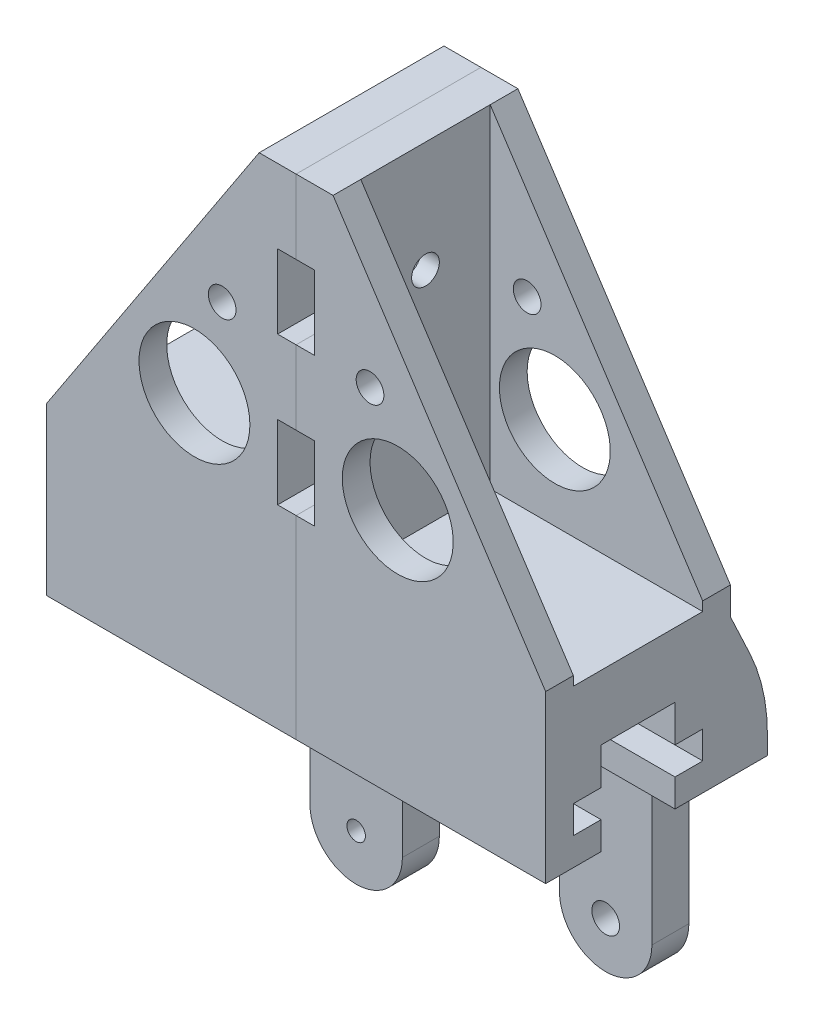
ISO-10303-21;
HEADER;
FILE_DESCRIPTION(('STEP AP214'),'2;1');
FILE_NAME('part.step','',(''),(''),'','','');
FILE_SCHEMA(('AUTOMOTIVE_DESIGN { 1 0 10303 214 1 1 1 1 }'));
ENDSEC;
DATA;
#1=APPLICATION_CONTEXT('core data for automotive mechanical design processes');
#2=APPLICATION_PROTOCOL_DEFINITION('international standard','automotive_design',2000,#1);
#3=PRODUCT_CONTEXT('',#1,'mechanical');
#4=PRODUCT('Part','Part','',(#3));
#5=PRODUCT_RELATED_PRODUCT_CATEGORY('part','',(#4));
#6=PRODUCT_DEFINITION_FORMATION('','',#4);
#7=PRODUCT_DEFINITION_CONTEXT('part definition',#1,'design');
#8=PRODUCT_DEFINITION('design','',#6,#7);
#9=PRODUCT_DEFINITION_SHAPE('','',#8);
#10=(LENGTH_UNIT() NAMED_UNIT(*) SI_UNIT(.MILLI.,.METRE.));
#11=(NAMED_UNIT(*) PLANE_ANGLE_UNIT() SI_UNIT($,.RADIAN.));
#12=(NAMED_UNIT(*) SI_UNIT($,.STERADIAN.) SOLID_ANGLE_UNIT());
#13=UNCERTAINTY_MEASURE_WITH_UNIT(LENGTH_MEASURE(1.E-05),#10,'distance_accuracy_value','');
#14=(GEOMETRIC_REPRESENTATION_CONTEXT(3) GLOBAL_UNCERTAINTY_ASSIGNED_CONTEXT((#13)) GLOBAL_UNIT_ASSIGNED_CONTEXT((#10,
#11,#12)) REPRESENTATION_CONTEXT('',''));
#15=CARTESIAN_POINT('',(0.,0.,0.));
#16=DIRECTION('',(0.,0.,1.));
#17=DIRECTION('',(1.,0.,0.));
#18=AXIS2_PLACEMENT_3D('',#15,#16,#17);
#19=CARTESIAN_POINT('',(-4.,-38.,10.));
#20=DIRECTION('',(-1.,0.,0.));
#21=DIRECTION('',(0.,0.,-1.));
#22=AXIS2_PLACEMENT_3D('',#19,#20,#21);
#23=PLANE('',#22);
#24=CARTESIAN_POINT('',(-4.00000000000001,-28.,0.));
#25=DIRECTION('',(-1.,0.,0.));
#26=DIRECTION('',(0.,0.,1.));
#27=AXIS2_PLACEMENT_3D('',#24,#25,#26);
#28=CIRCLE('',#27,1.5);
#29=CARTESIAN_POINT('',(-4.00000000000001,-28.,1.5));
#30=VERTEX_POINT('',#29);
#31=EDGE_CURVE('E445',#30,#30,#28,.T.);
#32=ORIENTED_EDGE('',*,*,#31,.T.);
#33=EDGE_LOOP('',(#32));
#34=FACE_BOUND('',#33,.T.);
#35=DIRECTION('',(0.,0.,-1.));
#36=VECTOR('',#35,1.);
#37=CARTESIAN_POINT('',(-4.00000000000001,-32.,10.));
#38=LINE('',#37,#36);
#39=CARTESIAN_POINT('',(-4.00000000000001,-32.,10.));
#40=VERTEX_POINT('',#39);
#41=CARTESIAN_POINT('',(-4.00000000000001,-32.,-10.));
#42=VERTEX_POINT('',#41);
#43=EDGE_CURVE('E486',#40,#42,#38,.T.);
#44=ORIENTED_EDGE('',*,*,#43,.T.);
#45=DIRECTION('',(0.,-1.,0.));
#46=VECTOR('',#45,1.);
#47=CARTESIAN_POINT('',(-4.,-38.,-10.));
#48=LINE('',#47,#46);
#49=CARTESIAN_POINT('',(-4.00000000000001,-24.,-10.));
#50=VERTEX_POINT('',#49);
#51=EDGE_CURVE('E575',#50,#42,#48,.T.);
#52=ORIENTED_EDGE('',*,*,#51,.F.);
#53=DIRECTION('',(0.,0.,-1.));
#54=VECTOR('',#53,1.);
#55=CARTESIAN_POINT('',(-4.00000000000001,-24.,10.));
#56=LINE('',#55,#54);
#57=CARTESIAN_POINT('',(-4.00000000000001,-24.,10.));
#58=VERTEX_POINT('',#57);
#59=EDGE_CURVE('E522',#58,#50,#56,.T.);
#60=ORIENTED_EDGE('',*,*,#59,.F.);
#61=DIRECTION('',(0.,-1.,0.));
#62=VECTOR('',#61,1.);
#63=CARTESIAN_POINT('',(-4.,-38.,10.));
#64=LINE('',#63,#62);
#65=EDGE_CURVE('E526',#58,#40,#64,.T.);
#66=ORIENTED_EDGE('',*,*,#65,.T.);
#67=EDGE_LOOP('',(#44,#52,#60,#66));
#68=FACE_BOUND('',#67,.T.);
#69=ADVANCED_FACE('F47',(#34,#68),#23,.F.);
#70=CARTESIAN_POINT('',(-4.00000000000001,-12.,0.));
#71=DIRECTION('',(-1.,0.,0.));
#72=DIRECTION('',(0.,0.,1.));
#73=AXIS2_PLACEMENT_3D('',#70,#71,#72);
#74=CIRCLE('',#73,1.5);
#75=CARTESIAN_POINT('',(-4.00000000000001,-12.,1.5));
#76=VERTEX_POINT('',#75);
#77=EDGE_CURVE('E448',#76,#76,#74,.T.);
#78=ORIENTED_EDGE('',*,*,#77,.T.);
#79=EDGE_LOOP('',(#78));
#80=FACE_BOUND('',#79,.T.);
#81=DIRECTION('',(0.,0.,-1.));
#82=VECTOR('',#81,1.);
#83=CARTESIAN_POINT('',(-4.00000000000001,-8.,10.));
#84=LINE('',#83,#82);
#85=CARTESIAN_POINT('',(-4.00000000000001,-8.,10.));
#86=VERTEX_POINT('',#85);
#87=CARTESIAN_POINT('',(-4.00000000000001,-8.,-10.));
#88=VERTEX_POINT('',#87);
#89=EDGE_CURVE('E496',#86,#88,#84,.T.);
#90=ORIENTED_EDGE('',*,*,#89,.F.);
#91=CARTESIAN_POINT('',(-4.00000000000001,-16.,10.));
#92=VERTEX_POINT('',#91);
#93=EDGE_CURVE('E582',#86,#92,#64,.T.);
#94=ORIENTED_EDGE('',*,*,#93,.T.);
#95=DIRECTION('',(0.,0.,-1.));
#96=VECTOR('',#95,1.);
#97=CARTESIAN_POINT('',(-4.00000000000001,-16.,10.));
#98=LINE('',#97,#96);
#99=CARTESIAN_POINT('',(-4.00000000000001,-16.,-10.));
#100=VERTEX_POINT('',#99);
#101=EDGE_CURVE('E539',#92,#100,#98,.T.);
#102=ORIENTED_EDGE('',*,*,#101,.T.);
#103=EDGE_CURVE('E586',#88,#100,#48,.T.);
#104=ORIENTED_EDGE('',*,*,#103,.F.);
#105=EDGE_LOOP('',(#90,#94,#102,#104));
#106=FACE_BOUND('',#105,.T.);
#107=ADVANCED_FACE('F670',(#80,#106),#23,.F.);
#108=CARTESIAN_POINT('',(-6.00000000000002,0.,10.));
#109=DIRECTION('',(0.835705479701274,-0.549177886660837,0.));
#110=DIRECTION('',(-0.549177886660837,-0.835705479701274,0.));
#111=AXIS2_PLACEMENT_3D('',#108,#109,#110);
#112=PLANE('',#111);
#113=DIRECTION('',(0.549177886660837,0.835705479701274,0.));
#114=VECTOR('',#113,1.);
#115=CARTESIAN_POINT('',(-5.39680729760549,0.917901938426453,-7.));
#116=LINE('',#115,#114);
#117=CARTESIAN_POINT('',(-29.,-35.,-7.));
#118=VERTEX_POINT('',#117);
#119=CARTESIAN_POINT('',(-6.00000000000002,0.,-7.));
#120=VERTEX_POINT('',#119);
#121=EDGE_CURVE('E565',#118,#120,#116,.T.);
#122=ORIENTED_EDGE('',*,*,#121,.T.);
#123=DIRECTION('',(0.,0.,-1.));
#124=VECTOR('',#123,1.);
#125=CARTESIAN_POINT('',(-6.00000000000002,0.,10.));
#126=LINE('',#125,#124);
#127=CARTESIAN_POINT('',(-6.00000000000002,0.,-10.));
#128=VERTEX_POINT('',#127);
#129=EDGE_CURVE('E615',#120,#128,#126,.T.);
#130=ORIENTED_EDGE('',*,*,#129,.T.);
#131=DIRECTION('',(0.549177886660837,0.835705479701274,0.));
#132=VECTOR('',#131,1.);
#133=CARTESIAN_POINT('',(-6.00000000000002,0.,-10.));
#134=LINE('',#133,#132);
#135=CARTESIAN_POINT('',(-29.,-35.,-10.));
#136=VERTEX_POINT('',#135);
#137=EDGE_CURVE('E636',#136,#128,#134,.T.);
#138=ORIENTED_EDGE('',*,*,#137,.F.);
#139=DIRECTION('',(0.,0.,-1.));
#140=VECTOR('',#139,1.);
#141=CARTESIAN_POINT('',(-29.,-35.,10.));
#142=LINE('',#141,#140);
#143=EDGE_CURVE('E55',#118,#136,#142,.T.);
#144=ORIENTED_EDGE('',*,*,#143,.F.);
#145=EDGE_LOOP('',(#122,#130,#138,#144));
#146=FACE_BOUND('',#145,.T.);
#147=ADVANCED_FACE('F703',(#146),#112,.F.);
#148=CARTESIAN_POINT('',(-29.,-35.,10.));
#149=DIRECTION('',(1.,0.,0.));
#150=DIRECTION('',(0.,0.,1.));
#151=AXIS2_PLACEMENT_3D('',#148,#149,#150);
#152=PLANE('',#151);
#153=DIRECTION('',(0.,1.,0.));
#154=VECTOR('',#153,1.);
#155=CARTESIAN_POINT('',(-29.,-36.,-7.));
#156=LINE('',#155,#154);
#157=CARTESIAN_POINT('',(-29.,-36.,-7.));
#158=VERTEX_POINT('',#157);
#159=EDGE_CURVE('E550',#158,#118,#156,.T.);
#160=ORIENTED_EDGE('',*,*,#159,.T.);
#161=ORIENTED_EDGE('',*,*,#143,.T.);
#162=DIRECTION('',(0.,1.,0.));
#163=VECTOR('',#162,1.);
#164=CARTESIAN_POINT('',(-29.,-35.,-10.));
#165=LINE('',#164,#163);
#166=CARTESIAN_POINT('',(-29.,-38.,-10.));
#167=VERTEX_POINT('',#166);
#168=EDGE_CURVE('E635',#167,#136,#165,.T.);
#169=ORIENTED_EDGE('',*,*,#168,.F.);
#170=DIRECTION('',(0.,0.905882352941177,0.423529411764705));
#171=VECTOR('',#170,1.);
#172=CARTESIAN_POINT('',(-29.,-38.,-10.));
#173=LINE('',#172,#171);
#174=CARTESIAN_POINT('',(-29.,-42.5294117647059,-12.1176470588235));
#175=VERTEX_POINT('',#174);
#176=EDGE_CURVE('E365',#175,#167,#173,.T.);
#177=ORIENTED_EDGE('',*,*,#176,.F.);
#178=CARTESIAN_POINT('',(-29.,-51.,6.));
#179=DIRECTION('',(1.,0.,0.));
#180=DIRECTION('',(0.,0.,-1.));
#181=AXIS2_PLACEMENT_3D('',#178,#179,#180);
#182=CIRCLE('',#181,20.);
#183=CARTESIAN_POINT('',(-29.,-51.,-14.));
#184=VERTEX_POINT('',#183);
#185=EDGE_CURVE('E315',#184,#175,#182,.T.);
#186=ORIENTED_EDGE('',*,*,#185,.F.);
#187=DIRECTION('',(0.,1.,0.));
#188=VECTOR('',#187,1.);
#189=CARTESIAN_POINT('',(-29.,-51.,-14.));
#190=LINE('',#189,#188);
#191=CARTESIAN_POINT('',(-29.,-53.,-14.));
#192=VERTEX_POINT('',#191);
#193=EDGE_CURVE('E407',#192,#184,#190,.T.);
#194=ORIENTED_EDGE('',*,*,#193,.F.);
#195=DIRECTION('',(0.,0.,-1.));
#196=VECTOR('',#195,1.);
#197=CARTESIAN_POINT('',(-29.,-53.,-14.));
#198=LINE('',#197,#196);
#199=CARTESIAN_POINT('',(-29.,-53.,-4.));
#200=VERTEX_POINT('',#199);
#201=EDGE_CURVE('E404',#200,#192,#198,.T.);
#202=ORIENTED_EDGE('',*,*,#201,.F.);
#203=DIRECTION('',(0.,-1.,0.));
#204=VECTOR('',#203,1.);
#205=CARTESIAN_POINT('',(-29.,-50.,-4.));
#206=LINE('',#205,#204);
#207=CARTESIAN_POINT('',(-29.,-50.,-4.));
#208=VERTEX_POINT('',#207);
#209=EDGE_CURVE('E401',#208,#200,#206,.T.);
#210=ORIENTED_EDGE('',*,*,#209,.F.);
#211=DIRECTION('',(0.,0.,1.));
#212=VECTOR('',#211,1.);
#213=CARTESIAN_POINT('',(-29.,-50.,-7.));
#214=LINE('',#213,#212);
#215=CARTESIAN_POINT('',(-29.,-50.,-7.));
#216=VERTEX_POINT('',#215);
#217=EDGE_CURVE('E398',#216,#208,#214,.T.);
#218=ORIENTED_EDGE('',*,*,#217,.F.);
#219=DIRECTION('',(0.,-1.,0.));
#220=VECTOR('',#219,1.);
#221=CARTESIAN_POINT('',(-29.,-47.,-7.));
#222=LINE('',#221,#220);
#223=CARTESIAN_POINT('',(-29.,-47.,-7.));
#224=VERTEX_POINT('',#223);
#225=EDGE_CURVE('E395',#224,#216,#222,.T.);
#226=ORIENTED_EDGE('',*,*,#225,.F.);
#227=DIRECTION('',(0.,0.,-1.));
#228=VECTOR('',#227,1.);
#229=CARTESIAN_POINT('',(-29.,-47.,-4.));
#230=LINE('',#229,#228);
#231=CARTESIAN_POINT('',(-29.,-47.,-4.));
#232=VERTEX_POINT('',#231);
#233=EDGE_CURVE('E392',#232,#224,#230,.T.);
#234=ORIENTED_EDGE('',*,*,#233,.F.);
#235=DIRECTION('',(0.,-1.,0.));
#236=VECTOR('',#235,1.);
#237=CARTESIAN_POINT('',(-29.,-43.,-4.));
#238=LINE('',#237,#236);
#239=CARTESIAN_POINT('',(-29.,-43.,-4.));
#240=VERTEX_POINT('',#239);
#241=EDGE_CURVE('E389',#240,#232,#238,.T.);
#242=ORIENTED_EDGE('',*,*,#241,.F.);
#243=DIRECTION('',(0.,0.,-1.));
#244=VECTOR('',#243,1.);
#245=CARTESIAN_POINT('',(-29.,-43.,4.));
#246=LINE('',#245,#244);
#247=CARTESIAN_POINT('',(-29.,-43.,4.));
#248=VERTEX_POINT('',#247);
#249=EDGE_CURVE('E386',#248,#240,#246,.T.);
#250=ORIENTED_EDGE('',*,*,#249,.F.);
#251=DIRECTION('',(0.,1.,0.));
#252=VECTOR('',#251,1.);
#253=CARTESIAN_POINT('',(-29.,-43.,4.));
#254=LINE('',#253,#252);
#255=CARTESIAN_POINT('',(-29.,-47.,4.));
#256=VERTEX_POINT('',#255);
#257=EDGE_CURVE('E383',#256,#248,#254,.T.);
#258=ORIENTED_EDGE('',*,*,#257,.F.);
#259=DIRECTION('',(0.,0.,-1.));
#260=VECTOR('',#259,1.);
#261=CARTESIAN_POINT('',(-29.,-47.,4.));
#262=LINE('',#261,#260);
#263=CARTESIAN_POINT('',(-29.,-47.,7.));
#264=VERTEX_POINT('',#263);
#265=EDGE_CURVE('E380',#264,#256,#262,.T.);
#266=ORIENTED_EDGE('',*,*,#265,.F.);
#267=DIRECTION('',(0.,1.,0.));
#268=VECTOR('',#267,1.);
#269=CARTESIAN_POINT('',(-29.,-47.,7.));
#270=LINE('',#269,#268);
#271=CARTESIAN_POINT('',(-29.,-50.,7.));
#272=VERTEX_POINT('',#271);
#273=EDGE_CURVE('E377',#272,#264,#270,.T.);
#274=ORIENTED_EDGE('',*,*,#273,.F.);
#275=DIRECTION('',(0.,0.,1.));
#276=VECTOR('',#275,1.);
#277=CARTESIAN_POINT('',(-29.,-50.,7.));
#278=LINE('',#277,#276);
#279=CARTESIAN_POINT('',(-29.,-50.,4.));
#280=VERTEX_POINT('',#279);
#281=EDGE_CURVE('E374',#280,#272,#278,.T.);
#282=ORIENTED_EDGE('',*,*,#281,.F.);
#283=DIRECTION('',(0.,1.,0.));
#284=VECTOR('',#283,1.);
#285=CARTESIAN_POINT('',(-29.,-50.,4.));
#286=LINE('',#285,#284);
#287=CARTESIAN_POINT('',(-29.,-53.,4.));
#288=VERTEX_POINT('',#287);
#289=EDGE_CURVE('E371',#288,#280,#286,.T.);
#290=ORIENTED_EDGE('',*,*,#289,.F.);
#291=DIRECTION('',(0.,0.,-1.));
#292=VECTOR('',#291,1.);
#293=CARTESIAN_POINT('',(-29.,-53.,4.));
#294=LINE('',#293,#292);
#295=CARTESIAN_POINT('',(-29.,-53.,10.));
#296=VERTEX_POINT('',#295);
#297=EDGE_CURVE('E368',#296,#288,#294,.T.);
#298=ORIENTED_EDGE('',*,*,#297,.F.);
#299=DIRECTION('',(0.,1.,0.));
#300=VECTOR('',#299,1.);
#301=CARTESIAN_POINT('',(-29.,-35.,10.));
#302=LINE('',#301,#300);
#303=CARTESIAN_POINT('',(-29.,-35.,10.));
#304=VERTEX_POINT('',#303);
#305=EDGE_CURVE('E578',#296,#304,#302,.T.);
#306=ORIENTED_EDGE('',*,*,#305,.T.);
#307=CARTESIAN_POINT('',(-29.,-35.,7.));
#308=VERTEX_POINT('',#307);
#309=EDGE_CURVE('E12',#304,#308,#142,.T.);
#310=ORIENTED_EDGE('',*,*,#309,.T.);
#311=DIRECTION('',(0.,1.,0.));
#312=VECTOR('',#311,1.);
#313=CARTESIAN_POINT('',(-29.,-36.,7.));
#314=LINE('',#313,#312);
#315=CARTESIAN_POINT('',(-29.,-36.,7.));
#316=VERTEX_POINT('',#315);
#317=EDGE_CURVE('E558',#316,#308,#314,.T.);
#318=ORIENTED_EDGE('',*,*,#317,.F.);
#319=DIRECTION('',(0.,0.,1.));
#320=VECTOR('',#319,1.);
#321=CARTESIAN_POINT('',(-29.,-36.,-7.));
#322=LINE('',#321,#320);
#323=EDGE_CURVE('E556',#158,#316,#322,.T.);
#324=ORIENTED_EDGE('',*,*,#323,.F.);
#325=EDGE_LOOP('',(#160,#161,#169,#177,#186,#194,#202,#210,#218,#226,#234,#242,#250,#258,#266,
#274,#282,#290,#298,#306,#310,#318,#324));
#326=FACE_BOUND('',#325,.T.);
#327=ADVANCED_FACE('F682',(#326),#152,.F.);
#328=ORIENTED_EDGE('',*,*,#309,.F.);
#329=DIRECTION('',(0.549177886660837,0.835705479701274,0.));
#330=VECTOR('',#329,1.);
#331=CARTESIAN_POINT('',(-6.00000000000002,0.,10.));
#332=LINE('',#331,#330);
#333=CARTESIAN_POINT('',(-6.00000000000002,0.,10.));
#334=VERTEX_POINT('',#333);
#335=EDGE_CURVE('E621',#304,#334,#332,.T.);
#336=ORIENTED_EDGE('',*,*,#335,.T.);
#337=CARTESIAN_POINT('',(-6.00000000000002,0.,7.));
#338=VERTEX_POINT('',#337);
#339=EDGE_CURVE('E612',#334,#338,#126,.T.);
#340=ORIENTED_EDGE('',*,*,#339,.T.);
#341=DIRECTION('',(0.549177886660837,0.835705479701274,0.));
#342=VECTOR('',#341,1.);
#343=CARTESIAN_POINT('',(-5.39680729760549,0.917901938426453,7.));
#344=LINE('',#343,#342);
#345=EDGE_CURVE('E573',#308,#338,#344,.T.);
#346=ORIENTED_EDGE('',*,*,#345,.F.);
#347=EDGE_LOOP('',(#328,#336,#340,#346));
#348=FACE_BOUND('',#347,.T.);
#349=ADVANCED_FACE('F620',(#348),#112,.F.);
#350=CARTESIAN_POINT('',(-4.00000000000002,0.,10.));
#351=DIRECTION('',(0.,-1.,0.));
#352=DIRECTION('',(0.,0.,-1.));
#353=AXIS2_PLACEMENT_3D('',#350,#351,#352);
#354=PLANE('',#353);
#355=DIRECTION('',(1.,0.,0.));
#356=VECTOR('',#355,1.);
#357=CARTESIAN_POINT('',(-4.00000000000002,0.,-10.));
#358=LINE('',#357,#356);
#359=CARTESIAN_POINT('',(-2.00000000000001,0.,-10.));
#360=VERTEX_POINT('',#359);
#361=EDGE_CURVE('E626',#128,#360,#358,.T.);
#362=ORIENTED_EDGE('',*,*,#361,.F.);
#363=ORIENTED_EDGE('',*,*,#129,.F.);
#364=DIRECTION('',(0.,0.,1.));
#365=VECTOR('',#364,1.);
#366=CARTESIAN_POINT('',(-6.00000000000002,0.,-7.));
#367=LINE('',#366,#365);
#368=EDGE_CURVE('E566',#120,#338,#367,.T.);
#369=ORIENTED_EDGE('',*,*,#368,.T.);
#370=ORIENTED_EDGE('',*,*,#339,.F.);
#371=DIRECTION('',(1.,0.,0.));
#372=VECTOR('',#371,1.);
#373=CARTESIAN_POINT('',(-4.00000000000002,0.,10.));
#374=LINE('',#373,#372);
#375=CARTESIAN_POINT('',(-2.00000000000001,0.,10.));
#376=VERTEX_POINT('',#375);
#377=EDGE_CURVE('E624',#334,#376,#374,.T.);
#378=ORIENTED_EDGE('',*,*,#377,.T.);
#379=DIRECTION('',(0.,0.,-1.));
#380=VECTOR('',#379,1.);
#381=CARTESIAN_POINT('',(-2.00000000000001,0.,10.));
#382=LINE('',#381,#380);
#383=EDGE_CURVE('E504',#376,#360,#382,.T.);
#384=ORIENTED_EDGE('',*,*,#383,.T.);
#385=EDGE_LOOP('',(#362,#363,#369,#370,#378,#384));
#386=FACE_BOUND('',#385,.T.);
#387=ADVANCED_FACE('F609',(#386),#354,.F.);
#388=CARTESIAN_POINT('',(-4.00000000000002,0.,10.));
#389=DIRECTION('',(0.,0.,-1.));
#390=DIRECTION('',(1.,0.,0.));
#391=AXIS2_PLACEMENT_3D('',#388,#389,#390);
#392=PLANE('',#391);
#393=CARTESIAN_POINT('',(-10.,-16.,10.));
#394=DIRECTION('',(0.,0.,1.));
#395=DIRECTION('',(1.,0.,0.));
#396=AXIS2_PLACEMENT_3D('',#393,#394,#395);
#397=CIRCLE('',#396,1.5);
#398=CARTESIAN_POINT('',(-8.50000000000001,-16.,10.));
#399=VERTEX_POINT('',#398);
#400=EDGE_CURVE('E452',#399,#399,#397,.T.);
#401=ORIENTED_EDGE('',*,*,#400,.F.);
#402=EDGE_LOOP('',(#401));
#403=FACE_BOUND('',#402,.T.);
#404=CARTESIAN_POINT('',(-13.,-26.,10.));
#405=DIRECTION('',(0.,0.,1.));
#406=DIRECTION('',(1.,0.,0.));
#407=AXIS2_PLACEMENT_3D('',#404,#405,#406);
#408=CIRCLE('',#407,6.);
#409=CARTESIAN_POINT('',(-7.00000000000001,-26.,10.));
#410=VERTEX_POINT('',#409);
#411=EDGE_CURVE('E463',#410,#410,#408,.T.);
#412=ORIENTED_EDGE('',*,*,#411,.F.);
#413=EDGE_LOOP('',(#412));
#414=FACE_BOUND('',#413,.T.);
#415=ORIENTED_EDGE('',*,*,#377,.F.);
#416=ORIENTED_EDGE('',*,*,#335,.F.);
#417=ORIENTED_EDGE('',*,*,#305,.F.);
#418=DIRECTION('',(-1.,0.,0.));
#419=VECTOR('',#418,1.);
#420=CARTESIAN_POINT('',(26.3019433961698,-53.,10.));
#421=LINE('',#420,#419);
#422=CARTESIAN_POINT('',(-2.,-53.,10.));
#423=VERTEX_POINT('',#422);
#424=EDGE_CURVE('E440',#423,#296,#421,.T.);
#425=ORIENTED_EDGE('',*,*,#424,.F.);
#426=DIRECTION('',(0.,-1.,0.));
#427=VECTOR('',#426,1.);
#428=CARTESIAN_POINT('',(-2.00000000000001,-32.,10.));
#429=LINE('',#428,#427);
#430=CARTESIAN_POINT('',(-2.00000000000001,-32.,10.));
#431=VERTEX_POINT('',#430);
#432=EDGE_CURVE('E476',#431,#423,#429,.T.);
#433=ORIENTED_EDGE('',*,*,#432,.F.);
#434=DIRECTION('',(1.,0.,0.));
#435=VECTOR('',#434,1.);
#436=CARTESIAN_POINT('',(-4.00000000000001,-32.,10.));
#437=LINE('',#436,#435);
#438=EDGE_CURVE('E473',#40,#431,#437,.T.);
#439=ORIENTED_EDGE('',*,*,#438,.F.);
#440=ORIENTED_EDGE('',*,*,#65,.F.);
#441=DIRECTION('',(-1.,0.,0.));
#442=VECTOR('',#441,1.);
#443=CARTESIAN_POINT('',(-4.00000000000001,-24.,10.));
#444=LINE('',#443,#442);
#445=CARTESIAN_POINT('',(-2.00000000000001,-24.,10.));
#446=VERTEX_POINT('',#445);
#447=EDGE_CURVE('E511',#446,#58,#444,.T.);
#448=ORIENTED_EDGE('',*,*,#447,.F.);
#449=DIRECTION('',(0.,-1.,0.));
#450=VECTOR('',#449,1.);
#451=CARTESIAN_POINT('',(-2.00000000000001,-16.,10.));
#452=LINE('',#451,#450);
#453=CARTESIAN_POINT('',(-2.00000000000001,-16.,10.));
#454=VERTEX_POINT('',#453);
#455=EDGE_CURVE('E508',#454,#446,#452,.T.);
#456=ORIENTED_EDGE('',*,*,#455,.F.);
#457=DIRECTION('',(1.,0.,0.));
#458=VECTOR('',#457,1.);
#459=CARTESIAN_POINT('',(-4.00000000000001,-16.,10.));
#460=LINE('',#459,#458);
#461=EDGE_CURVE('E512',#92,#454,#460,.T.);
#462=ORIENTED_EDGE('',*,*,#461,.F.);
#463=ORIENTED_EDGE('',*,*,#93,.F.);
#464=DIRECTION('',(-1.,0.,0.));
#465=VECTOR('',#464,1.);
#466=CARTESIAN_POINT('',(-4.00000000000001,-8.,10.));
#467=LINE('',#466,#465);
#468=CARTESIAN_POINT('',(-2.00000000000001,-8.,10.));
#469=VERTEX_POINT('',#468);
#470=EDGE_CURVE('E493',#469,#86,#467,.T.);
#471=ORIENTED_EDGE('',*,*,#470,.F.);
#472=DIRECTION('',(0.,-1.,0.));
#473=VECTOR('',#472,1.);
#474=CARTESIAN_POINT('',(-2.00000000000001,0.,10.));
#475=LINE('',#474,#473);
#476=EDGE_CURVE('E490',#376,#469,#475,.T.);
#477=ORIENTED_EDGE('',*,*,#476,.F.);
#478=EDGE_LOOP('',(#415,#416,#417,#425,#433,#439,#440,#448,#456,#462,#463,#471,#477));
#479=FACE_BOUND('',#478,.T.);
#480=ADVANCED_FACE('F661',(#403,#414,#479),#392,.F.);
#481=CARTESIAN_POINT('',(-4.00000000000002,0.,-10.));
#482=DIRECTION('',(0.,0.,-1.));
#483=DIRECTION('',(1.,0.,0.));
#484=AXIS2_PLACEMENT_3D('',#481,#482,#483);
#485=PLANE('',#484);
#486=CARTESIAN_POINT('',(-10.,-16.,-10.));
#487=DIRECTION('',(0.,0.,1.));
#488=DIRECTION('',(1.,0.,0.));
#489=AXIS2_PLACEMENT_3D('',#486,#487,#488);
#490=CIRCLE('',#489,1.5);
#491=CARTESIAN_POINT('',(-8.50000000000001,-16.,-10.));
#492=VERTEX_POINT('',#491);
#493=EDGE_CURVE('E456',#492,#492,#490,.T.);
#494=ORIENTED_EDGE('',*,*,#493,.T.);
#495=EDGE_LOOP('',(#494));
#496=FACE_BOUND('',#495,.T.);
#497=CARTESIAN_POINT('',(-13.,-26.,-10.));
#498=DIRECTION('',(0.,0.,1.));
#499=DIRECTION('',(1.,0.,0.));
#500=AXIS2_PLACEMENT_3D('',#497,#498,#499);
#501=CIRCLE('',#500,6.);
#502=CARTESIAN_POINT('',(-7.00000000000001,-26.,-10.));
#503=VERTEX_POINT('',#502);
#504=EDGE_CURVE('E462',#503,#503,#501,.T.);
#505=ORIENTED_EDGE('',*,*,#504,.T.);
#506=EDGE_LOOP('',(#505));
#507=FACE_BOUND('',#506,.T.);
#508=ORIENTED_EDGE('',*,*,#103,.T.);
#509=DIRECTION('',(1.,0.,0.));
#510=VECTOR('',#509,1.);
#511=CARTESIAN_POINT('',(-4.00000000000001,-16.,-10.));
#512=LINE('',#511,#510);
#513=CARTESIAN_POINT('',(-2.00000000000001,-16.,-10.));
#514=VERTEX_POINT('',#513);
#515=EDGE_CURVE('E507',#100,#514,#512,.T.);
#516=ORIENTED_EDGE('',*,*,#515,.T.);
#517=DIRECTION('',(0.,-1.,0.));
#518=VECTOR('',#517,1.);
#519=CARTESIAN_POINT('',(-2.00000000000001,-16.,-10.));
#520=LINE('',#519,#518);
#521=CARTESIAN_POINT('',(-2.00000000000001,-24.,-10.));
#522=VERTEX_POINT('',#521);
#523=EDGE_CURVE('E513',#514,#522,#520,.T.);
#524=ORIENTED_EDGE('',*,*,#523,.T.);
#525=DIRECTION('',(-1.,0.,0.));
#526=VECTOR('',#525,1.);
#527=CARTESIAN_POINT('',(-4.00000000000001,-24.,-10.));
#528=LINE('',#527,#526);
#529=EDGE_CURVE('E516',#522,#50,#528,.T.);
#530=ORIENTED_EDGE('',*,*,#529,.T.);
#531=ORIENTED_EDGE('',*,*,#51,.T.);
#532=DIRECTION('',(1.,0.,0.));
#533=VECTOR('',#532,1.);
#534=CARTESIAN_POINT('',(-4.00000000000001,-32.,-10.));
#535=LINE('',#534,#533);
#536=CARTESIAN_POINT('',(-2.00000000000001,-32.,-10.));
#537=VERTEX_POINT('',#536);
#538=EDGE_CURVE('E472',#42,#537,#535,.T.);
#539=ORIENTED_EDGE('',*,*,#538,.T.);
#540=DIRECTION('',(0.,-1.,0.));
#541=VECTOR('',#540,1.);
#542=CARTESIAN_POINT('',(-2.00000000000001,-32.,-10.));
#543=LINE('',#542,#541);
#544=CARTESIAN_POINT('',(-2.,-38.,-10.));
#545=VERTEX_POINT('',#544);
#546=EDGE_CURVE('E477',#537,#545,#543,.T.);
#547=ORIENTED_EDGE('',*,*,#546,.T.);
#548=DIRECTION('',(-1.,0.,0.));
#549=VECTOR('',#548,1.);
#550=CARTESIAN_POINT('',(-29.,-38.,-10.));
#551=LINE('',#550,#549);
#552=EDGE_CURVE('E632',#545,#167,#551,.T.);
#553=ORIENTED_EDGE('',*,*,#552,.T.);
#554=ORIENTED_EDGE('',*,*,#168,.T.);
#555=ORIENTED_EDGE('',*,*,#137,.T.);
#556=ORIENTED_EDGE('',*,*,#361,.T.);
#557=DIRECTION('',(0.,-1.,0.));
#558=VECTOR('',#557,1.);
#559=CARTESIAN_POINT('',(-2.00000000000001,0.,-10.));
#560=LINE('',#559,#558);
#561=CARTESIAN_POINT('',(-2.00000000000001,-8.,-10.));
#562=VERTEX_POINT('',#561);
#563=EDGE_CURVE('E489',#360,#562,#560,.T.);
#564=ORIENTED_EDGE('',*,*,#563,.T.);
#565=DIRECTION('',(-1.,0.,0.));
#566=VECTOR('',#565,1.);
#567=CARTESIAN_POINT('',(-4.00000000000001,-8.,-10.));
#568=LINE('',#567,#566);
#569=EDGE_CURVE('E494',#562,#88,#568,.T.);
#570=ORIENTED_EDGE('',*,*,#569,.T.);
#571=EDGE_LOOP('',(#508,#516,#524,#530,#531,#539,#547,#553,#554,#555,#556,#564,#570));
#572=FACE_BOUND('',#571,.T.);
#573=ADVANCED_FACE('F654',(#496,#507,#572),#485,.T.);
#574=CARTESIAN_POINT('',(-4.00000000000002,0.,7.));
#575=DIRECTION('',(0.,0.,-1.));
#576=DIRECTION('',(1.,0.,0.));
#577=AXIS2_PLACEMENT_3D('',#574,#575,#576);
#578=PLANE('',#577);
#579=CARTESIAN_POINT('',(-10.,-16.,7.));
#580=DIRECTION('',(0.,0.,1.));
#581=DIRECTION('',(1.,0.,0.));
#582=AXIS2_PLACEMENT_3D('',#579,#580,#581);
#583=CIRCLE('',#582,1.5);
#584=CARTESIAN_POINT('',(-8.50000000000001,-16.,7.));
#585=VERTEX_POINT('',#584);
#586=EDGE_CURVE('E459',#585,#585,#583,.T.);
#587=ORIENTED_EDGE('',*,*,#586,.T.);
#588=EDGE_LOOP('',(#587));
#589=FACE_BOUND('',#588,.T.);
#590=CARTESIAN_POINT('',(-13.,-26.,7.));
#591=DIRECTION('',(0.,0.,1.));
#592=DIRECTION('',(1.,0.,0.));
#593=AXIS2_PLACEMENT_3D('',#590,#591,#592);
#594=CIRCLE('',#593,6.);
#595=CARTESIAN_POINT('',(-7.00000000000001,-26.,7.));
#596=VERTEX_POINT('',#595);
#597=EDGE_CURVE('E469',#596,#596,#594,.T.);
#598=ORIENTED_EDGE('',*,*,#597,.T.);
#599=EDGE_LOOP('',(#598));
#600=FACE_BOUND('',#599,.T.);
#601=DIRECTION('',(0.,-1.,0.));
#602=VECTOR('',#601,1.);
#603=CARTESIAN_POINT('',(-6.00000000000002,0.,7.));
#604=LINE('',#603,#602);
#605=CARTESIAN_POINT('',(-6.00000000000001,-36.,7.));
#606=VERTEX_POINT('',#605);
#607=EDGE_CURVE('E551',#338,#606,#604,.T.);
#608=ORIENTED_EDGE('',*,*,#607,.T.);
#609=DIRECTION('',(-1.,0.,0.));
#610=VECTOR('',#609,1.);
#611=CARTESIAN_POINT('',(-6.00000000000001,-36.,7.));
#612=LINE('',#611,#610);
#613=EDGE_CURVE('E543',#606,#316,#612,.T.);
#614=ORIENTED_EDGE('',*,*,#613,.T.);
#615=ORIENTED_EDGE('',*,*,#317,.T.);
#616=ORIENTED_EDGE('',*,*,#345,.T.);
#617=EDGE_LOOP('',(#608,#614,#615,#616));
#618=FACE_BOUND('',#617,.T.);
#619=ADVANCED_FACE('F616',(#589,#600,#618),#578,.T.);
#620=CARTESIAN_POINT('',(-4.00000000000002,0.,-7.));
#621=DIRECTION('',(0.,0.,-1.));
#622=DIRECTION('',(1.,0.,0.));
#623=AXIS2_PLACEMENT_3D('',#620,#621,#622);
#624=PLANE('',#623);
#625=CARTESIAN_POINT('',(-10.,-16.,-7.));
#626=DIRECTION('',(0.,0.,1.));
#627=DIRECTION('',(1.,0.,0.));
#628=AXIS2_PLACEMENT_3D('',#625,#626,#627);
#629=CIRCLE('',#628,1.5);
#630=CARTESIAN_POINT('',(-8.50000000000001,-16.,-7.));
#631=VERTEX_POINT('',#630);
#632=EDGE_CURVE('E455',#631,#631,#629,.T.);
#633=ORIENTED_EDGE('',*,*,#632,.F.);
#634=EDGE_LOOP('',(#633));
#635=FACE_BOUND('',#634,.T.);
#636=CARTESIAN_POINT('',(-13.,-26.,-7.));
#637=DIRECTION('',(0.,0.,1.));
#638=DIRECTION('',(1.,0.,0.));
#639=AXIS2_PLACEMENT_3D('',#636,#637,#638);
#640=CIRCLE('',#639,6.);
#641=CARTESIAN_POINT('',(-7.00000000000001,-26.,-7.));
#642=VERTEX_POINT('',#641);
#643=EDGE_CURVE('E466',#642,#642,#640,.T.);
#644=ORIENTED_EDGE('',*,*,#643,.F.);
#645=EDGE_LOOP('',(#644));
#646=FACE_BOUND('',#645,.T.);
#647=ORIENTED_EDGE('',*,*,#121,.F.);
#648=ORIENTED_EDGE('',*,*,#159,.F.);
#649=DIRECTION('',(-1.,0.,0.));
#650=VECTOR('',#649,1.);
#651=CARTESIAN_POINT('',(-6.00000000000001,-36.,-7.));
#652=LINE('',#651,#650);
#653=CARTESIAN_POINT('',(-6.00000000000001,-36.,-7.));
#654=VERTEX_POINT('',#653);
#655=EDGE_CURVE('E548',#654,#158,#652,.T.);
#656=ORIENTED_EDGE('',*,*,#655,.F.);
#657=DIRECTION('',(0.,-1.,0.));
#658=VECTOR('',#657,1.);
#659=CARTESIAN_POINT('',(-6.00000000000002,0.,-7.));
#660=LINE('',#659,#658);
#661=EDGE_CURVE('E553',#120,#654,#660,.T.);
#662=ORIENTED_EDGE('',*,*,#661,.F.);
#663=EDGE_LOOP('',(#647,#648,#656,#662));
#664=FACE_BOUND('',#663,.T.);
#665=ADVANCED_FACE('F705',(#635,#646,#664),#624,.F.);
#666=CARTESIAN_POINT('',(-6.00000000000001,-36.,-7.));
#667=DIRECTION('',(0.,-1.,0.));
#668=DIRECTION('',(0.,0.,-1.));
#669=AXIS2_PLACEMENT_3D('',#666,#667,#668);
#670=PLANE('',#669);
#671=ORIENTED_EDGE('',*,*,#613,.F.);
#672=DIRECTION('',(0.,0.,1.));
#673=VECTOR('',#672,1.);
#674=CARTESIAN_POINT('',(-6.00000000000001,-36.,-7.));
#675=LINE('',#674,#673);
#676=EDGE_CURVE('E563',#654,#606,#675,.T.);
#677=ORIENTED_EDGE('',*,*,#676,.F.);
#678=ORIENTED_EDGE('',*,*,#655,.T.);
#679=ORIENTED_EDGE('',*,*,#323,.T.);
#680=EDGE_LOOP('',(#671,#677,#678,#679));
#681=FACE_BOUND('',#680,.T.);
#682=ADVANCED_FACE('F600',(#681),#670,.F.);
#683=CARTESIAN_POINT('',(-6.00000000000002,0.,-7.));
#684=DIRECTION('',(1.,0.,0.));
#685=DIRECTION('',(0.,-1.,0.));
#686=AXIS2_PLACEMENT_3D('',#683,#684,#685);
#687=PLANE('',#686);
#688=CARTESIAN_POINT('',(-6.00000000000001,-28.,0.));
#689=DIRECTION('',(-1.,0.,0.));
#690=DIRECTION('',(0.,-1.,0.));
#691=AXIS2_PLACEMENT_3D('',#688,#689,#690);
#692=CIRCLE('',#691,1.5);
#693=CARTESIAN_POINT('',(-6.00000000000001,-29.5,0.));
#694=VERTEX_POINT('',#693);
#695=EDGE_CURVE('E50',#694,#694,#692,.T.);
#696=ORIENTED_EDGE('',*,*,#695,.F.);
#697=EDGE_LOOP('',(#696));
#698=FACE_BOUND('',#697,.T.);
#699=CARTESIAN_POINT('',(-6.00000000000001,-12.,0.));
#700=DIRECTION('',(-1.,0.,0.));
#701=DIRECTION('',(0.,-1.,0.));
#702=AXIS2_PLACEMENT_3D('',#699,#700,#701);
#703=CIRCLE('',#702,1.5);
#704=CARTESIAN_POINT('',(-6.00000000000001,-13.5,0.));
#705=VERTEX_POINT('',#704);
#706=EDGE_CURVE('E451',#705,#705,#703,.T.);
#707=ORIENTED_EDGE('',*,*,#706,.F.);
#708=EDGE_LOOP('',(#707));
#709=FACE_BOUND('',#708,.T.);
#710=ORIENTED_EDGE('',*,*,#607,.F.);
#711=ORIENTED_EDGE('',*,*,#368,.F.);
#712=ORIENTED_EDGE('',*,*,#661,.T.);
#713=ORIENTED_EDGE('',*,*,#676,.T.);
#714=EDGE_LOOP('',(#710,#711,#712,#713));
#715=FACE_BOUND('',#714,.T.);
#716=ADVANCED_FACE('F596',(#698,#709,#715),#687,.F.);
#717=CARTESIAN_POINT('',(-4.00000000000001,-16.,10.));
#718=DIRECTION('',(0.,-1.,0.));
#719=DIRECTION('',(0.,0.,-1.));
#720=AXIS2_PLACEMENT_3D('',#717,#718,#719);
#721=PLANE('',#720);
#722=ORIENTED_EDGE('',*,*,#515,.F.);
#723=ORIENTED_EDGE('',*,*,#101,.F.);
#724=ORIENTED_EDGE('',*,*,#461,.T.);
#725=DIRECTION('',(0.,0.,-1.));
#726=VECTOR('',#725,1.);
#727=CARTESIAN_POINT('',(-2.00000000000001,-16.,10.));
#728=LINE('',#727,#726);
#729=EDGE_CURVE('E544',#454,#514,#728,.T.);
#730=ORIENTED_EDGE('',*,*,#729,.T.);
#731=EDGE_LOOP('',(#722,#723,#724,#730));
#732=FACE_BOUND('',#731,.T.);
#733=ADVANCED_FACE('F599',(#732),#721,.F.);
#734=CARTESIAN_POINT('',(-2.00000000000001,-16.,10.));
#735=DIRECTION('',(-1.,0.,0.));
#736=DIRECTION('',(0.,1.,0.));
#737=AXIS2_PLACEMENT_3D('',#734,#735,#736);
#738=PLANE('',#737);
#739=ORIENTED_EDGE('',*,*,#523,.F.);
#740=ORIENTED_EDGE('',*,*,#729,.F.);
#741=ORIENTED_EDGE('',*,*,#455,.T.);
#742=DIRECTION('',(0.,0.,-1.));
#743=VECTOR('',#742,1.);
#744=CARTESIAN_POINT('',(-2.00000000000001,-24.,10.));
#745=LINE('',#744,#743);
#746=EDGE_CURVE('E519',#446,#522,#745,.T.);
#747=ORIENTED_EDGE('',*,*,#746,.T.);
#748=EDGE_LOOP('',(#739,#740,#741,#747));
#749=FACE_BOUND('',#748,.T.);
#750=ADVANCED_FACE('F665',(#749),#738,.F.);
#751=CARTESIAN_POINT('',(-4.00000000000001,-24.,10.));
#752=DIRECTION('',(0.,1.,0.));
#753=DIRECTION('',(0.,0.,1.));
#754=AXIS2_PLACEMENT_3D('',#751,#752,#753);
#755=PLANE('',#754);
#756=ORIENTED_EDGE('',*,*,#529,.F.);
#757=ORIENTED_EDGE('',*,*,#746,.F.);
#758=ORIENTED_EDGE('',*,*,#447,.T.);
#759=ORIENTED_EDGE('',*,*,#59,.T.);
#760=EDGE_LOOP('',(#756,#757,#758,#759));
#761=FACE_BOUND('',#760,.T.);
#762=ADVANCED_FACE('F659',(#761),#755,.F.);
#763=CARTESIAN_POINT('',(-2.00000000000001,0.,10.));
#764=DIRECTION('',(-1.,0.,0.));
#765=DIRECTION('',(0.,1.,0.));
#766=AXIS2_PLACEMENT_3D('',#763,#764,#765);
#767=PLANE('',#766);
#768=ORIENTED_EDGE('',*,*,#563,.F.);
#769=ORIENTED_EDGE('',*,*,#383,.F.);
#770=ORIENTED_EDGE('',*,*,#476,.T.);
#771=DIRECTION('',(0.,0.,-1.));
#772=VECTOR('',#771,1.);
#773=CARTESIAN_POINT('',(-2.00000000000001,-8.,10.));
#774=LINE('',#773,#772);
#775=EDGE_CURVE('E502',#469,#562,#774,.T.);
#776=ORIENTED_EDGE('',*,*,#775,.T.);
#777=EDGE_LOOP('',(#768,#769,#770,#776));
#778=FACE_BOUND('',#777,.T.);
#779=ADVANCED_FACE('F677',(#778),#767,.F.);
#780=CARTESIAN_POINT('',(-4.00000000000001,-8.,10.));
#781=DIRECTION('',(0.,1.,0.));
#782=DIRECTION('',(0.,0.,1.));
#783=AXIS2_PLACEMENT_3D('',#780,#781,#782);
#784=PLANE('',#783);
#785=ORIENTED_EDGE('',*,*,#569,.F.);
#786=ORIENTED_EDGE('',*,*,#775,.F.);
#787=ORIENTED_EDGE('',*,*,#470,.T.);
#788=ORIENTED_EDGE('',*,*,#89,.T.);
#789=EDGE_LOOP('',(#785,#786,#787,#788));
#790=FACE_BOUND('',#789,.T.);
#791=ADVANCED_FACE('F675',(#790),#784,.F.);
#792=CARTESIAN_POINT('',(-4.00000000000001,-32.,10.));
#793=DIRECTION('',(0.,-1.,0.));
#794=DIRECTION('',(0.,0.,-1.));
#795=AXIS2_PLACEMENT_3D('',#792,#793,#794);
#796=PLANE('',#795);
#797=ORIENTED_EDGE('',*,*,#538,.F.);
#798=ORIENTED_EDGE('',*,*,#43,.F.);
#799=ORIENTED_EDGE('',*,*,#438,.T.);
#800=DIRECTION('',(0.,0.,-1.));
#801=VECTOR('',#800,1.);
#802=CARTESIAN_POINT('',(-2.00000000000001,-32.,10.));
#803=LINE('',#802,#801);
#804=EDGE_CURVE('E480',#431,#537,#803,.T.);
#805=ORIENTED_EDGE('',*,*,#804,.T.);
#806=EDGE_LOOP('',(#797,#798,#799,#805));
#807=FACE_BOUND('',#806,.T.);
#808=ADVANCED_FACE('F650',(#807),#796,.F.);
#809=CARTESIAN_POINT('',(-2.00000000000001,-32.,10.));
#810=DIRECTION('',(-1.,0.,0.));
#811=DIRECTION('',(0.,1.,0.));
#812=AXIS2_PLACEMENT_3D('',#809,#810,#811);
#813=PLANE('',#812);
#814=ORIENTED_EDGE('',*,*,#546,.F.);
#815=ORIENTED_EDGE('',*,*,#804,.F.);
#816=ORIENTED_EDGE('',*,*,#432,.T.);
#817=DIRECTION('',(0.,0.,1.));
#818=VECTOR('',#817,1.);
#819=CARTESIAN_POINT('',(-2.,-53.,4.));
#820=LINE('',#819,#818);
#821=CARTESIAN_POINT('',(-2.,-53.,4.));
#822=VERTEX_POINT('',#821);
#823=EDGE_CURVE('E317',#822,#423,#820,.T.);
#824=ORIENTED_EDGE('',*,*,#823,.F.);
#825=DIRECTION('',(0.,-1.,0.));
#826=VECTOR('',#825,1.);
#827=CARTESIAN_POINT('',(-2.,-50.,4.));
#828=LINE('',#827,#826);
#829=CARTESIAN_POINT('',(-2.,-50.,4.));
#830=VERTEX_POINT('',#829);
#831=EDGE_CURVE('E319',#830,#822,#828,.T.);
#832=ORIENTED_EDGE('',*,*,#831,.F.);
#833=DIRECTION('',(0.,0.,-1.));
#834=VECTOR('',#833,1.);
#835=CARTESIAN_POINT('',(-2.,-50.,7.));
#836=LINE('',#835,#834);
#837=CARTESIAN_POINT('',(-2.,-50.,7.));
#838=VERTEX_POINT('',#837);
#839=EDGE_CURVE('E323',#838,#830,#836,.T.);
#840=ORIENTED_EDGE('',*,*,#839,.F.);
#841=DIRECTION('',(0.,-1.,0.));
#842=VECTOR('',#841,1.);
#843=CARTESIAN_POINT('',(-2.,-47.,7.));
#844=LINE('',#843,#842);
#845=CARTESIAN_POINT('',(-2.,-47.,7.));
#846=VERTEX_POINT('',#845);
#847=EDGE_CURVE('E326',#846,#838,#844,.T.);
#848=ORIENTED_EDGE('',*,*,#847,.F.);
#849=DIRECTION('',(0.,0.,1.));
#850=VECTOR('',#849,1.);
#851=CARTESIAN_POINT('',(-2.,-47.,4.));
#852=LINE('',#851,#850);
#853=CARTESIAN_POINT('',(-2.,-47.,4.));
#854=VERTEX_POINT('',#853);
#855=EDGE_CURVE('E329',#854,#846,#852,.T.);
#856=ORIENTED_EDGE('',*,*,#855,.F.);
#857=DIRECTION('',(0.,-1.,0.));
#858=VECTOR('',#857,1.);
#859=CARTESIAN_POINT('',(-2.,-43.,4.));
#860=LINE('',#859,#858);
#861=CARTESIAN_POINT('',(-2.,-43.,4.));
#862=VERTEX_POINT('',#861);
#863=EDGE_CURVE('E332',#862,#854,#860,.T.);
#864=ORIENTED_EDGE('',*,*,#863,.F.);
#865=DIRECTION('',(0.,0.,1.));
#866=VECTOR('',#865,1.);
#867=CARTESIAN_POINT('',(-2.,-43.,4.));
#868=LINE('',#867,#866);
#869=CARTESIAN_POINT('',(-2.,-43.,-4.));
#870=VERTEX_POINT('',#869);
#871=EDGE_CURVE('E335',#870,#862,#868,.T.);
#872=ORIENTED_EDGE('',*,*,#871,.F.);
#873=DIRECTION('',(0.,1.,0.));
#874=VECTOR('',#873,1.);
#875=CARTESIAN_POINT('',(-2.,-43.,-4.));
#876=LINE('',#875,#874);
#877=CARTESIAN_POINT('',(-2.,-47.,-4.));
#878=VERTEX_POINT('',#877);
#879=EDGE_CURVE('E338',#878,#870,#876,.T.);
#880=ORIENTED_EDGE('',*,*,#879,.F.);
#881=DIRECTION('',(0.,0.,1.));
#882=VECTOR('',#881,1.);
#883=CARTESIAN_POINT('',(-2.,-47.,-4.));
#884=LINE('',#883,#882);
#885=CARTESIAN_POINT('',(-2.,-47.,-7.));
#886=VERTEX_POINT('',#885);
#887=EDGE_CURVE('E341',#886,#878,#884,.T.);
#888=ORIENTED_EDGE('',*,*,#887,.F.);
#889=DIRECTION('',(0.,1.,0.));
#890=VECTOR('',#889,1.);
#891=CARTESIAN_POINT('',(-2.,-47.,-7.));
#892=LINE('',#891,#890);
#893=CARTESIAN_POINT('',(-2.,-50.,-7.));
#894=VERTEX_POINT('',#893);
#895=EDGE_CURVE('E344',#894,#886,#892,.T.);
#896=ORIENTED_EDGE('',*,*,#895,.F.);
#897=DIRECTION('',(0.,0.,-1.));
#898=VECTOR('',#897,1.);
#899=CARTESIAN_POINT('',(-2.,-50.,-7.));
#900=LINE('',#899,#898);
#901=CARTESIAN_POINT('',(-2.,-50.,-4.));
#902=VERTEX_POINT('',#901);
#903=EDGE_CURVE('E347',#902,#894,#900,.T.);
#904=ORIENTED_EDGE('',*,*,#903,.F.);
#905=DIRECTION('',(0.,1.,0.));
#906=VECTOR('',#905,1.);
#907=CARTESIAN_POINT('',(-2.,-50.,-4.));
#908=LINE('',#907,#906);
#909=CARTESIAN_POINT('',(-2.,-53.,-4.));
#910=VERTEX_POINT('',#909);
#911=EDGE_CURVE('E350',#910,#902,#908,.T.);
#912=ORIENTED_EDGE('',*,*,#911,.F.);
#913=DIRECTION('',(0.,0.,1.));
#914=VECTOR('',#913,1.);
#915=CARTESIAN_POINT('',(-2.,-53.,-14.));
#916=LINE('',#915,#914);
#917=CARTESIAN_POINT('',(-2.,-53.,-14.));
#918=VERTEX_POINT('',#917);
#919=EDGE_CURVE('E353',#918,#910,#916,.T.);
#920=ORIENTED_EDGE('',*,*,#919,.F.);
#921=DIRECTION('',(0.,-1.,0.));
#922=VECTOR('',#921,1.);
#923=CARTESIAN_POINT('',(-2.,-51.,-14.));
#924=LINE('',#923,#922);
#925=CARTESIAN_POINT('',(-2.,-51.,-14.));
#926=VERTEX_POINT('',#925);
#927=EDGE_CURVE('E356',#926,#918,#924,.T.);
#928=ORIENTED_EDGE('',*,*,#927,.F.);
#929=CARTESIAN_POINT('',(-2.,-51.,6.));
#930=DIRECTION('',(1.,0.,0.));
#931=DIRECTION('',(0.,1.,0.));
#932=AXIS2_PLACEMENT_3D('',#929,#930,#931);
#933=CIRCLE('',#932,20.);
#934=CARTESIAN_POINT('',(-2.,-42.5294117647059,-12.1176470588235));
#935=VERTEX_POINT('',#934);
#936=EDGE_CURVE('E359',#935,#926,#933,.F.);
#937=ORIENTED_EDGE('',*,*,#936,.F.);
#938=DIRECTION('',(0.,-0.905882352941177,-0.423529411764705));
#939=VECTOR('',#938,1.);
#940=CARTESIAN_POINT('',(-2.,-38.,-10.));
#941=LINE('',#940,#939);
#942=EDGE_CURVE('E362',#545,#935,#941,.T.);
#943=ORIENTED_EDGE('',*,*,#942,.F.);
#944=EDGE_LOOP('',(#814,#815,#816,#824,#832,#840,#848,#856,#864,#872,#880,#888,#896,#904,#912,
#920,#928,#937,#943));
#945=FACE_BOUND('',#944,.T.);
#946=ADVANCED_FACE('F690',(#945),#813,.F.);
#947=CARTESIAN_POINT('',(-13.,-26.,10.));
#948=DIRECTION('',(0.,0.,-1.));
#949=DIRECTION('',(1.,0.,0.));
#950=AXIS2_PLACEMENT_3D('',#947,#948,#949);
#951=CYLINDRICAL_SURFACE('',#950,6.);
#952=ORIENTED_EDGE('',*,*,#504,.F.);
#953=EDGE_LOOP('',(#952));
#954=FACE_BOUND('',#953,.T.);
#955=ORIENTED_EDGE('',*,*,#643,.T.);
#956=EDGE_LOOP('',(#955));
#957=FACE_BOUND('',#956,.T.);
#958=ADVANCED_FACE('F750',(#954,#957),#951,.F.);
#959=ORIENTED_EDGE('',*,*,#597,.F.);
#960=EDGE_LOOP('',(#959));
#961=FACE_BOUND('',#960,.T.);
#962=ORIENTED_EDGE('',*,*,#411,.T.);
#963=EDGE_LOOP('',(#962));
#964=FACE_BOUND('',#963,.T.);
#965=ADVANCED_FACE('F747',(#961,#964),#951,.F.);
#966=CARTESIAN_POINT('',(-10.,-16.,10.));
#967=DIRECTION('',(0.,0.,-1.));
#968=DIRECTION('',(1.,0.,0.));
#969=AXIS2_PLACEMENT_3D('',#966,#967,#968);
#970=CYLINDRICAL_SURFACE('',#969,1.5);
#971=ORIENTED_EDGE('',*,*,#493,.F.);
#972=EDGE_LOOP('',(#971));
#973=FACE_BOUND('',#972,.T.);
#974=ORIENTED_EDGE('',*,*,#632,.T.);
#975=EDGE_LOOP('',(#974));
#976=FACE_BOUND('',#975,.T.);
#977=ADVANCED_FACE('F745',(#973,#976),#970,.F.);
#978=ORIENTED_EDGE('',*,*,#586,.F.);
#979=EDGE_LOOP('',(#978));
#980=FACE_BOUND('',#979,.T.);
#981=ORIENTED_EDGE('',*,*,#400,.T.);
#982=EDGE_LOOP('',(#981));
#983=FACE_BOUND('',#982,.T.);
#984=ADVANCED_FACE('F738',(#980,#983),#970,.F.);
#985=CARTESIAN_POINT('',(-24.,-12.,0.));
#986=DIRECTION('',(1.,0.,0.));
#987=DIRECTION('',(0.,0.,1.));
#988=AXIS2_PLACEMENT_3D('',#985,#986,#987);
#989=CYLINDRICAL_SURFACE('',#988,1.5);
#990=ORIENTED_EDGE('',*,*,#77,.F.);
#991=EDGE_LOOP('',(#990));
#992=FACE_BOUND('',#991,.T.);
#993=ORIENTED_EDGE('',*,*,#706,.T.);
#994=EDGE_LOOP('',(#993));
#995=FACE_BOUND('',#994,.T.);
#996=ADVANCED_FACE('F594',(#992,#995),#989,.F.);
#997=CARTESIAN_POINT('',(-24.,-28.,0.));
#998=DIRECTION('',(1.,0.,0.));
#999=DIRECTION('',(0.,0.,1.));
#1000=AXIS2_PLACEMENT_3D('',#997,#998,#999);
#1001=CYLINDRICAL_SURFACE('',#1000,1.5);
#1002=ORIENTED_EDGE('',*,*,#31,.F.);
#1003=EDGE_LOOP('',(#1002));
#1004=FACE_BOUND('',#1003,.T.);
#1005=ORIENTED_EDGE('',*,*,#695,.T.);
#1006=EDGE_LOOP('',(#1005));
#1007=FACE_BOUND('',#1006,.T.);
#1008=ADVANCED_FACE('F724',(#1004,#1007),#1001,.F.);
#1009=CARTESIAN_POINT('',(26.3019433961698,-51.,6.));
#1010=DIRECTION('',(-1.,0.,0.));
#1011=DIRECTION('',(0.,0.,-1.));
#1012=AXIS2_PLACEMENT_3D('',#1009,#1010,#1011);
#1013=CYLINDRICAL_SURFACE('',#1012,20.);
#1014=ORIENTED_EDGE('',*,*,#936,.T.);
#1015=DIRECTION('',(-1.,0.,0.));
#1016=VECTOR('',#1015,1.);
#1017=CARTESIAN_POINT('',(26.3019433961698,-51.,-14.));
#1018=LINE('',#1017,#1016);
#1019=EDGE_CURVE('E320',#926,#184,#1018,.T.);
#1020=ORIENTED_EDGE('',*,*,#1019,.T.);
#1021=ORIENTED_EDGE('',*,*,#185,.T.);
#1022=DIRECTION('',(-1.,0.,0.));
#1023=VECTOR('',#1022,1.);
#1024=CARTESIAN_POINT('',(26.3019433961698,-42.5294117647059,-12.1176470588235));
#1025=LINE('',#1024,#1023);
#1026=EDGE_CURVE('E410',#935,#175,#1025,.T.);
#1027=ORIENTED_EDGE('',*,*,#1026,.F.);
#1028=EDGE_LOOP('',(#1014,#1020,#1021,#1027));
#1029=FACE_BOUND('',#1028,.T.);
#1030=ADVANCED_FACE('F727',(#1029),#1013,.T.);
#1031=CARTESIAN_POINT('',(26.3019433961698,-51.,-14.));
#1032=DIRECTION('',(0.,0.,-1.));
#1033=DIRECTION('',(0.,1.,0.));
#1034=AXIS2_PLACEMENT_3D('',#1031,#1032,#1033);
#1035=PLANE('',#1034);
#1036=CARTESIAN_POINT('',(-15.5,-78.3,-14.));
#1037=DIRECTION('',(0.,0.,-1.));
#1038=DIRECTION('',(0.,1.,0.));
#1039=AXIS2_PLACEMENT_3D('',#1036,#1037,#1038);
#1040=CIRCLE('',#1039,1.);
#1041=CARTESIAN_POINT('',(-15.5,-77.3,-14.));
#1042=VERTEX_POINT('',#1041);
#1043=EDGE_CURVE('E304',#1042,#1042,#1040,.T.);
#1044=ORIENTED_EDGE('',*,*,#1043,.F.);
#1045=EDGE_LOOP('',(#1044));
#1046=FACE_BOUND('',#1045,.T.);
#1047=ORIENTED_EDGE('',*,*,#927,.T.);
#1048=DIRECTION('',(-1.,0.,0.));
#1049=VECTOR('',#1048,1.);
#1050=CARTESIAN_POINT('',(26.3019433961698,-53.,-14.));
#1051=LINE('',#1050,#1049);
#1052=CARTESIAN_POINT('',(-10.5,-53.,-14.));
#1053=VERTEX_POINT('',#1052);
#1054=EDGE_CURVE('E412',#918,#1053,#1051,.T.);
#1055=ORIENTED_EDGE('',*,*,#1054,.T.);
#1056=DIRECTION('',(0.,1.,0.));
#1057=VECTOR('',#1056,1.);
#1058=CARTESIAN_POINT('',(-10.5,-53.,-14.));
#1059=LINE('',#1058,#1057);
#1060=CARTESIAN_POINT('',(-10.5,-78.3,-14.));
#1061=VERTEX_POINT('',#1060);
#1062=EDGE_CURVE('E307',#1061,#1053,#1059,.T.);
#1063=ORIENTED_EDGE('',*,*,#1062,.F.);
#1064=CARTESIAN_POINT('',(-15.5,-78.3,-14.));
#1065=DIRECTION('',(0.,0.,-1.));
#1066=DIRECTION('',(0.,1.,0.));
#1067=AXIS2_PLACEMENT_3D('',#1064,#1065,#1066);
#1068=CIRCLE('',#1067,5.);
#1069=CARTESIAN_POINT('',(-20.5,-78.3,-14.));
#1070=VERTEX_POINT('',#1069);
#1071=EDGE_CURVE('E296',#1061,#1070,#1068,.T.);
#1072=ORIENTED_EDGE('',*,*,#1071,.T.);
#1073=DIRECTION('',(0.,-1.,0.));
#1074=VECTOR('',#1073,1.);
#1075=CARTESIAN_POINT('',(-20.5,-53.,-14.));
#1076=LINE('',#1075,#1074);
#1077=CARTESIAN_POINT('',(-20.5,-53.,-14.));
#1078=VERTEX_POINT('',#1077);
#1079=EDGE_CURVE('E288',#1078,#1070,#1076,.T.);
#1080=ORIENTED_EDGE('',*,*,#1079,.F.);
#1081=EDGE_CURVE('E415',#1078,#192,#1051,.T.);
#1082=ORIENTED_EDGE('',*,*,#1081,.T.);
#1083=ORIENTED_EDGE('',*,*,#193,.T.);
#1084=ORIENTED_EDGE('',*,*,#1019,.F.);
#1085=EDGE_LOOP('',(#1047,#1055,#1063,#1072,#1080,#1082,#1083,#1084));
#1086=FACE_BOUND('',#1085,.T.);
#1087=ADVANCED_FACE('F735',(#1046,#1086),#1035,.T.);
#1088=CARTESIAN_POINT('',(26.3019433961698,-53.,-14.));
#1089=DIRECTION('',(0.,-1.,0.));
#1090=DIRECTION('',(0.,0.,-1.));
#1091=AXIS2_PLACEMENT_3D('',#1088,#1089,#1090);
#1092=PLANE('',#1091);
#1093=DIRECTION('',(0.,0.,-1.));
#1094=VECTOR('',#1093,1.);
#1095=CARTESIAN_POINT('',(-20.5,-53.,-10.));
#1096=LINE('',#1095,#1094);
#1097=CARTESIAN_POINT('',(-20.5,-53.,-10.));
#1098=VERTEX_POINT('',#1097);
#1099=EDGE_CURVE('E313',#1098,#1078,#1096,.T.);
#1100=ORIENTED_EDGE('',*,*,#1099,.F.);
#1101=DIRECTION('',(-1.,0.,0.));
#1102=VECTOR('',#1101,1.);
#1103=CARTESIAN_POINT('',(-20.5,-53.,-10.));
#1104=LINE('',#1103,#1102);
#1105=CARTESIAN_POINT('',(-10.5,-53.,-10.));
#1106=VERTEX_POINT('',#1105);
#1107=EDGE_CURVE('E287',#1106,#1098,#1104,.T.);
#1108=ORIENTED_EDGE('',*,*,#1107,.F.);
#1109=DIRECTION('',(0.,0.,-1.));
#1110=VECTOR('',#1109,1.);
#1111=CARTESIAN_POINT('',(-10.5,-53.,-10.));
#1112=LINE('',#1111,#1110);
#1113=EDGE_CURVE('E285',#1106,#1053,#1112,.T.);
#1114=ORIENTED_EDGE('',*,*,#1113,.T.);
#1115=ORIENTED_EDGE('',*,*,#1054,.F.);
#1116=ORIENTED_EDGE('',*,*,#919,.T.);
#1117=DIRECTION('',(-1.,0.,0.));
#1118=VECTOR('',#1117,1.);
#1119=CARTESIAN_POINT('',(26.3019433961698,-53.,-4.));
#1120=LINE('',#1119,#1118);
#1121=EDGE_CURVE('E416',#910,#200,#1120,.T.);
#1122=ORIENTED_EDGE('',*,*,#1121,.T.);
#1123=ORIENTED_EDGE('',*,*,#201,.T.);
#1124=ORIENTED_EDGE('',*,*,#1081,.F.);
#1125=EDGE_LOOP('',(#1100,#1108,#1114,#1115,#1116,#1122,#1123,#1124));
#1126=FACE_BOUND('',#1125,.T.);
#1127=ADVANCED_FACE('F834',(#1126),#1092,.T.);
#1128=CARTESIAN_POINT('',(26.3019433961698,-50.,-4.));
#1129=DIRECTION('',(0.,0.,1.));
#1130=DIRECTION('',(-1.,0.,0.));
#1131=AXIS2_PLACEMENT_3D('',#1128,#1129,#1130);
#1132=PLANE('',#1131);
#1133=ORIENTED_EDGE('',*,*,#911,.T.);
#1134=DIRECTION('',(-1.,0.,0.));
#1135=VECTOR('',#1134,1.);
#1136=CARTESIAN_POINT('',(26.3019433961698,-50.,-4.));
#1137=LINE('',#1136,#1135);
#1138=EDGE_CURVE('E418',#902,#208,#1137,.T.);
#1139=ORIENTED_EDGE('',*,*,#1138,.T.);
#1140=ORIENTED_EDGE('',*,*,#209,.T.);
#1141=ORIENTED_EDGE('',*,*,#1121,.F.);
#1142=EDGE_LOOP('',(#1133,#1139,#1140,#1141));
#1143=FACE_BOUND('',#1142,.T.);
#1144=ADVANCED_FACE('F838',(#1143),#1132,.T.);
#1145=CARTESIAN_POINT('',(26.3019433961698,-50.,-7.));
#1146=DIRECTION('',(0.,1.,0.));
#1147=DIRECTION('',(0.,0.,1.));
#1148=AXIS2_PLACEMENT_3D('',#1145,#1146,#1147);
#1149=PLANE('',#1148);
#1150=ORIENTED_EDGE('',*,*,#903,.T.);
#1151=DIRECTION('',(-1.,0.,0.));
#1152=VECTOR('',#1151,1.);
#1153=CARTESIAN_POINT('',(26.3019433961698,-50.,-7.));
#1154=LINE('',#1153,#1152);
#1155=EDGE_CURVE('E420',#894,#216,#1154,.T.);
#1156=ORIENTED_EDGE('',*,*,#1155,.T.);
#1157=ORIENTED_EDGE('',*,*,#217,.T.);
#1158=ORIENTED_EDGE('',*,*,#1138,.F.);
#1159=EDGE_LOOP('',(#1150,#1156,#1157,#1158));
#1160=FACE_BOUND('',#1159,.T.);
#1161=ADVANCED_FACE('F849',(#1160),#1149,.T.);
#1162=CARTESIAN_POINT('',(26.3019433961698,-47.,-7.));
#1163=DIRECTION('',(0.,0.,1.));
#1164=DIRECTION('',(0.,-1.,0.));
#1165=AXIS2_PLACEMENT_3D('',#1162,#1163,#1164);
#1166=PLANE('',#1165);
#1167=ORIENTED_EDGE('',*,*,#895,.T.);
#1168=DIRECTION('',(-1.,0.,0.));
#1169=VECTOR('',#1168,1.);
#1170=CARTESIAN_POINT('',(26.3019433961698,-47.,-7.));
#1171=LINE('',#1170,#1169);
#1172=EDGE_CURVE('E422',#886,#224,#1171,.T.);
#1173=ORIENTED_EDGE('',*,*,#1172,.T.);
#1174=ORIENTED_EDGE('',*,*,#225,.T.);
#1175=ORIENTED_EDGE('',*,*,#1155,.F.);
#1176=EDGE_LOOP('',(#1167,#1173,#1174,#1175));
#1177=FACE_BOUND('',#1176,.T.);
#1178=ADVANCED_FACE('F859',(#1177),#1166,.T.);
#1179=CARTESIAN_POINT('',(26.3019433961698,-47.,-4.));
#1180=DIRECTION('',(0.,-1.,0.));
#1181=DIRECTION('',(0.,0.,-1.));
#1182=AXIS2_PLACEMENT_3D('',#1179,#1180,#1181);
#1183=PLANE('',#1182);
#1184=ORIENTED_EDGE('',*,*,#887,.T.);
#1185=DIRECTION('',(-1.,0.,0.));
#1186=VECTOR('',#1185,1.);
#1187=CARTESIAN_POINT('',(26.3019433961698,-47.,-4.));
#1188=LINE('',#1187,#1186);
#1189=EDGE_CURVE('E424',#878,#232,#1188,.T.);
#1190=ORIENTED_EDGE('',*,*,#1189,.T.);
#1191=ORIENTED_EDGE('',*,*,#233,.T.);
#1192=ORIENTED_EDGE('',*,*,#1172,.F.);
#1193=EDGE_LOOP('',(#1184,#1190,#1191,#1192));
#1194=FACE_BOUND('',#1193,.T.);
#1195=ADVANCED_FACE('F869',(#1194),#1183,.T.);
#1196=CARTESIAN_POINT('',(26.3019433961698,-43.,-4.));
#1197=DIRECTION('',(0.,0.,1.));
#1198=DIRECTION('',(0.,-1.,0.));
#1199=AXIS2_PLACEMENT_3D('',#1196,#1197,#1198);
#1200=PLANE('',#1199);
#1201=ORIENTED_EDGE('',*,*,#879,.T.);
#1202=DIRECTION('',(-1.,0.,0.));
#1203=VECTOR('',#1202,1.);
#1204=CARTESIAN_POINT('',(26.3019433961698,-43.,-4.));
#1205=LINE('',#1204,#1203);
#1206=EDGE_CURVE('E426',#870,#240,#1205,.T.);
#1207=ORIENTED_EDGE('',*,*,#1206,.T.);
#1208=ORIENTED_EDGE('',*,*,#241,.T.);
#1209=ORIENTED_EDGE('',*,*,#1189,.F.);
#1210=EDGE_LOOP('',(#1201,#1207,#1208,#1209));
#1211=FACE_BOUND('',#1210,.T.);
#1212=ADVANCED_FACE('F879',(#1211),#1200,.T.);
#1213=CARTESIAN_POINT('',(26.3019433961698,-43.,4.));
#1214=DIRECTION('',(0.,-1.,0.));
#1215=DIRECTION('',(0.,0.,-1.));
#1216=AXIS2_PLACEMENT_3D('',#1213,#1214,#1215);
#1217=PLANE('',#1216);
#1218=ORIENTED_EDGE('',*,*,#871,.T.);
#1219=DIRECTION('',(-1.,0.,0.));
#1220=VECTOR('',#1219,1.);
#1221=CARTESIAN_POINT('',(26.3019433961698,-43.,4.));
#1222=LINE('',#1221,#1220);
#1223=EDGE_CURVE('E428',#862,#248,#1222,.T.);
#1224=ORIENTED_EDGE('',*,*,#1223,.T.);
#1225=ORIENTED_EDGE('',*,*,#249,.T.);
#1226=ORIENTED_EDGE('',*,*,#1206,.F.);
#1227=EDGE_LOOP('',(#1218,#1224,#1225,#1226));
#1228=FACE_BOUND('',#1227,.T.);
#1229=ADVANCED_FACE('F889',(#1228),#1217,.T.);
#1230=CARTESIAN_POINT('',(26.3019433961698,-43.,4.));
#1231=DIRECTION('',(0.,0.,-1.));
#1232=DIRECTION('',(0.,1.,0.));
#1233=AXIS2_PLACEMENT_3D('',#1230,#1231,#1232);
#1234=PLANE('',#1233);
#1235=ORIENTED_EDGE('',*,*,#863,.T.);
#1236=DIRECTION('',(-1.,0.,0.));
#1237=VECTOR('',#1236,1.);
#1238=CARTESIAN_POINT('',(26.3019433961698,-47.,4.));
#1239=LINE('',#1238,#1237);
#1240=EDGE_CURVE('E430',#854,#256,#1239,.T.);
#1241=ORIENTED_EDGE('',*,*,#1240,.T.);
#1242=ORIENTED_EDGE('',*,*,#257,.T.);
#1243=ORIENTED_EDGE('',*,*,#1223,.F.);
#1244=EDGE_LOOP('',(#1235,#1241,#1242,#1243));
#1245=FACE_BOUND('',#1244,.T.);
#1246=ADVANCED_FACE('F899',(#1245),#1234,.T.);
#1247=CARTESIAN_POINT('',(26.3019433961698,-47.,4.));
#1248=DIRECTION('',(0.,-1.,0.));
#1249=DIRECTION('',(0.,0.,-1.));
#1250=AXIS2_PLACEMENT_3D('',#1247,#1248,#1249);
#1251=PLANE('',#1250);
#1252=ORIENTED_EDGE('',*,*,#855,.T.);
#1253=DIRECTION('',(-1.,0.,0.));
#1254=VECTOR('',#1253,1.);
#1255=CARTESIAN_POINT('',(26.3019433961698,-47.,7.));
#1256=LINE('',#1255,#1254);
#1257=EDGE_CURVE('E432',#846,#264,#1256,.T.);
#1258=ORIENTED_EDGE('',*,*,#1257,.T.);
#1259=ORIENTED_EDGE('',*,*,#265,.T.);
#1260=ORIENTED_EDGE('',*,*,#1240,.F.);
#1261=EDGE_LOOP('',(#1252,#1258,#1259,#1260));
#1262=FACE_BOUND('',#1261,.T.);
#1263=ADVANCED_FACE('F909',(#1262),#1251,.T.);
#1264=CARTESIAN_POINT('',(26.3019433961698,-47.,7.));
#1265=DIRECTION('',(0.,0.,-1.));
#1266=DIRECTION('',(0.,1.,0.));
#1267=AXIS2_PLACEMENT_3D('',#1264,#1265,#1266);
#1268=PLANE('',#1267);
#1269=ORIENTED_EDGE('',*,*,#847,.T.);
#1270=DIRECTION('',(-1.,0.,0.));
#1271=VECTOR('',#1270,1.);
#1272=CARTESIAN_POINT('',(26.3019433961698,-50.,7.));
#1273=LINE('',#1272,#1271);
#1274=EDGE_CURVE('E434',#838,#272,#1273,.T.);
#1275=ORIENTED_EDGE('',*,*,#1274,.T.);
#1276=ORIENTED_EDGE('',*,*,#273,.T.);
#1277=ORIENTED_EDGE('',*,*,#1257,.F.);
#1278=EDGE_LOOP('',(#1269,#1275,#1276,#1277));
#1279=FACE_BOUND('',#1278,.T.);
#1280=ADVANCED_FACE('F919',(#1279),#1268,.T.);
#1281=CARTESIAN_POINT('',(26.3019433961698,-50.,7.));
#1282=DIRECTION('',(0.,1.,0.));
#1283=DIRECTION('',(0.,0.,1.));
#1284=AXIS2_PLACEMENT_3D('',#1281,#1282,#1283);
#1285=PLANE('',#1284);
#1286=ORIENTED_EDGE('',*,*,#839,.T.);
#1287=DIRECTION('',(-1.,0.,0.));
#1288=VECTOR('',#1287,1.);
#1289=CARTESIAN_POINT('',(26.3019433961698,-50.,4.));
#1290=LINE('',#1289,#1288);
#1291=EDGE_CURVE('E436',#830,#280,#1290,.T.);
#1292=ORIENTED_EDGE('',*,*,#1291,.T.);
#1293=ORIENTED_EDGE('',*,*,#281,.T.);
#1294=ORIENTED_EDGE('',*,*,#1274,.F.);
#1295=EDGE_LOOP('',(#1286,#1292,#1293,#1294));
#1296=FACE_BOUND('',#1295,.T.);
#1297=ADVANCED_FACE('F929',(#1296),#1285,.T.);
#1298=CARTESIAN_POINT('',(26.3019433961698,-50.,4.));
#1299=DIRECTION('',(0.,0.,-1.));
#1300=DIRECTION('',(1.,0.,0.));
#1301=AXIS2_PLACEMENT_3D('',#1298,#1299,#1300);
#1302=PLANE('',#1301);
#1303=ORIENTED_EDGE('',*,*,#831,.T.);
#1304=DIRECTION('',(-1.,0.,0.));
#1305=VECTOR('',#1304,1.);
#1306=CARTESIAN_POINT('',(26.3019433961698,-53.,4.));
#1307=LINE('',#1306,#1305);
#1308=EDGE_CURVE('E438',#822,#288,#1307,.T.);
#1309=ORIENTED_EDGE('',*,*,#1308,.T.);
#1310=ORIENTED_EDGE('',*,*,#289,.T.);
#1311=ORIENTED_EDGE('',*,*,#1291,.F.);
#1312=EDGE_LOOP('',(#1303,#1309,#1310,#1311));
#1313=FACE_BOUND('',#1312,.T.);
#1314=ADVANCED_FACE('F939',(#1313),#1302,.T.);
#1315=CARTESIAN_POINT('',(26.3019433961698,-53.,4.));
#1316=DIRECTION('',(0.,-1.,0.));
#1317=DIRECTION('',(0.,0.,-1.));
#1318=AXIS2_PLACEMENT_3D('',#1315,#1316,#1317);
#1319=PLANE('',#1318);
#1320=ORIENTED_EDGE('',*,*,#823,.T.);
#1321=ORIENTED_EDGE('',*,*,#424,.T.);
#1322=ORIENTED_EDGE('',*,*,#297,.T.);
#1323=ORIENTED_EDGE('',*,*,#1308,.F.);
#1324=EDGE_LOOP('',(#1320,#1321,#1322,#1323));
#1325=FACE_BOUND('',#1324,.T.);
#1326=ADVANCED_FACE('F686',(#1325),#1319,.T.);
#1327=CARTESIAN_POINT('',(26.3019433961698,-38.,-10.));
#1328=DIRECTION('',(0.,0.423529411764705,-0.905882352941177));
#1329=DIRECTION('',(0.,0.905882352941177,0.423529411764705));
#1330=AXIS2_PLACEMENT_3D('',#1327,#1328,#1329);
#1331=PLANE('',#1330);
#1332=ORIENTED_EDGE('',*,*,#942,.T.);
#1333=ORIENTED_EDGE('',*,*,#1026,.T.);
#1334=ORIENTED_EDGE('',*,*,#176,.T.);
#1335=ORIENTED_EDGE('',*,*,#552,.F.);
#1336=EDGE_LOOP('',(#1332,#1333,#1334,#1335));
#1337=FACE_BOUND('',#1336,.T.);
#1338=ADVANCED_FACE('F696',(#1337),#1331,.T.);
#1339=CARTESIAN_POINT('',(-20.5,-53.,-10.));
#1340=DIRECTION('',(-1.,0.,0.));
#1341=DIRECTION('',(0.,1.,0.));
#1342=AXIS2_PLACEMENT_3D('',#1339,#1340,#1341);
#1343=PLANE('',#1342);
#1344=ORIENTED_EDGE('',*,*,#1079,.T.);
#1345=DIRECTION('',(0.,0.,-1.));
#1346=VECTOR('',#1345,1.);
#1347=CARTESIAN_POINT('',(-20.5,-78.3,-10.));
#1348=LINE('',#1347,#1346);
#1349=CARTESIAN_POINT('',(-20.5,-78.3,-10.));
#1350=VERTEX_POINT('',#1349);
#1351=EDGE_CURVE('E297',#1350,#1070,#1348,.T.);
#1352=ORIENTED_EDGE('',*,*,#1351,.F.);
#1353=DIRECTION('',(0.,-1.,0.));
#1354=VECTOR('',#1353,1.);
#1355=CARTESIAN_POINT('',(-20.5,-53.,-10.));
#1356=LINE('',#1355,#1354);
#1357=EDGE_CURVE('E63',#1098,#1350,#1356,.T.);
#1358=ORIENTED_EDGE('',*,*,#1357,.F.);
#1359=ORIENTED_EDGE('',*,*,#1099,.T.);
#1360=EDGE_LOOP('',(#1344,#1352,#1358,#1359));
#1361=FACE_BOUND('',#1360,.T.);
#1362=ADVANCED_FACE('F966',(#1361),#1343,.T.);
#1363=CARTESIAN_POINT('',(-10.5,-53.,-10.));
#1364=DIRECTION('',(1.,0.,0.));
#1365=DIRECTION('',(0.,-1.,0.));
#1366=AXIS2_PLACEMENT_3D('',#1363,#1364,#1365);
#1367=PLANE('',#1366);
#1368=ORIENTED_EDGE('',*,*,#1062,.T.);
#1369=ORIENTED_EDGE('',*,*,#1113,.F.);
#1370=DIRECTION('',(0.,1.,0.));
#1371=VECTOR('',#1370,1.);
#1372=CARTESIAN_POINT('',(-10.5,-53.,-10.));
#1373=LINE('',#1372,#1371);
#1374=CARTESIAN_POINT('',(-10.5,-78.3,-10.));
#1375=VERTEX_POINT('',#1374);
#1376=EDGE_CURVE('E70',#1375,#1106,#1373,.T.);
#1377=ORIENTED_EDGE('',*,*,#1376,.F.);
#1378=DIRECTION('',(0.,0.,-1.));
#1379=VECTOR('',#1378,1.);
#1380=CARTESIAN_POINT('',(-10.5,-78.3,-10.));
#1381=LINE('',#1380,#1379);
#1382=EDGE_CURVE('E283',#1375,#1061,#1381,.T.);
#1383=ORIENTED_EDGE('',*,*,#1382,.T.);
#1384=EDGE_LOOP('',(#1368,#1369,#1377,#1383));
#1385=FACE_BOUND('',#1384,.T.);
#1386=ADVANCED_FACE('F282',(#1385),#1367,.T.);
#1387=CARTESIAN_POINT('',(-15.5,-73.,-10.));
#1388=DIRECTION('',(0.,0.,-1.));
#1389=DIRECTION('',(0.,1.,0.));
#1390=AXIS2_PLACEMENT_3D('',#1387,#1388,#1389);
#1391=PLANE('',#1390);
#1392=CARTESIAN_POINT('',(-15.5,-78.3,-10.));
#1393=DIRECTION('',(0.,0.,-1.));
#1394=DIRECTION('',(0.,1.,0.));
#1395=AXIS2_PLACEMENT_3D('',#1392,#1393,#1394);
#1396=CIRCLE('',#1395,1.);
#1397=CARTESIAN_POINT('',(-15.5,-77.3,-10.));
#1398=VERTEX_POINT('',#1397);
#1399=EDGE_CURVE('E301',#1398,#1398,#1396,.T.);
#1400=ORIENTED_EDGE('',*,*,#1399,.T.);
#1401=EDGE_LOOP('',(#1400));
#1402=FACE_BOUND('',#1401,.T.);
#1403=ORIENTED_EDGE('',*,*,#1357,.T.);
#1404=CARTESIAN_POINT('',(-15.5,-78.3,-10.));
#1405=DIRECTION('',(0.,0.,-1.));
#1406=DIRECTION('',(0.,1.,0.));
#1407=AXIS2_PLACEMENT_3D('',#1404,#1405,#1406);
#1408=CIRCLE('',#1407,5.);
#1409=EDGE_CURVE('E294',#1375,#1350,#1408,.T.);
#1410=ORIENTED_EDGE('',*,*,#1409,.F.);
#1411=ORIENTED_EDGE('',*,*,#1376,.T.);
#1412=ORIENTED_EDGE('',*,*,#1107,.T.);
#1413=EDGE_LOOP('',(#1403,#1410,#1411,#1412));
#1414=FACE_BOUND('',#1413,.T.);
#1415=ADVANCED_FACE('F299',(#1402,#1414),#1391,.F.);
#1416=CARTESIAN_POINT('',(-15.5,-78.3,-10.));
#1417=DIRECTION('',(0.,0.,-1.));
#1418=DIRECTION('',(0.,1.,0.));
#1419=AXIS2_PLACEMENT_3D('',#1416,#1417,#1418);
#1420=CYLINDRICAL_SURFACE('',#1419,5.);
#1421=ORIENTED_EDGE('',*,*,#1071,.F.);
#1422=ORIENTED_EDGE('',*,*,#1382,.F.);
#1423=ORIENTED_EDGE('',*,*,#1409,.T.);
#1424=ORIENTED_EDGE('',*,*,#1351,.T.);
#1425=EDGE_LOOP('',(#1421,#1422,#1423,#1424));
#1426=FACE_BOUND('',#1425,.T.);
#1427=ADVANCED_FACE('F292',(#1426),#1420,.T.);
#1428=CARTESIAN_POINT('',(-15.5,-78.3,-10.));
#1429=DIRECTION('',(0.,0.,-1.));
#1430=DIRECTION('',(0.,1.,0.));
#1431=AXIS2_PLACEMENT_3D('',#1428,#1429,#1430);
#1432=CYLINDRICAL_SURFACE('',#1431,1.);
#1433=ORIENTED_EDGE('',*,*,#1399,.F.);
#1434=EDGE_LOOP('',(#1433));
#1435=FACE_BOUND('',#1434,.T.);
#1436=ORIENTED_EDGE('',*,*,#1043,.T.);
#1437=EDGE_LOOP('',(#1436));
#1438=FACE_BOUND('',#1437,.T.);
#1439=ADVANCED_FACE('F996',(#1435,#1438),#1432,.F.);
#1440=CLOSED_SHELL('',(#69,#107,#147,#327,#349,#387,#480,#573,#619,#665,#682,#716,#733,#750,
#762,#779,#791,#808,#946,#958,#965,#977,#984,#996,#1008,#1030,#1087,#1127,#1144,#1161,#1178,
#1195,#1212,#1229,#1246,#1263,#1280,#1297,#1314,#1326,#1338,#1362,#1386,#1415,#1427,#1439));
#1441=MANIFOLD_SOLID_BREP('B2',#1440);
#1442=CARTESIAN_POINT('',(0.,-38.,10.));
#1443=DIRECTION('',(1.,0.,0.));
#1444=DIRECTION('',(0.,0.,-1.));
#1445=AXIS2_PLACEMENT_3D('',#1442,#1443,#1444);
#1446=PLANE('',#1445);
#1447=CARTESIAN_POINT('',(0.,-28.,0.));
#1448=DIRECTION('',(-1.,0.,0.));
#1449=DIRECTION('',(0.,0.,1.));
#1450=AXIS2_PLACEMENT_3D('',#1447,#1448,#1449);
#1451=CIRCLE('',#1450,1.5);
#1452=CARTESIAN_POINT('',(0.,-28.,1.5));
#1453=VERTEX_POINT('',#1452);
#1454=EDGE_CURVE('E1618',#1453,#1453,#1451,.T.);
#1455=ORIENTED_EDGE('',*,*,#1454,.F.);
#1456=EDGE_LOOP('',(#1455));
#1457=FACE_BOUND('',#1456,.T.);
#1458=DIRECTION('',(0.,0.,-1.));
#1459=VECTOR('',#1458,1.);
#1460=CARTESIAN_POINT('',(0.,-32.,10.));
#1461=LINE('',#1460,#1459);
#1462=CARTESIAN_POINT('',(0.,-32.,10.));
#1463=VERTEX_POINT('',#1462);
#1464=CARTESIAN_POINT('',(0.,-32.,-10.));
#1465=VERTEX_POINT('',#1464);
#1466=EDGE_CURVE('E1656',#1463,#1465,#1461,.T.);
#1467=ORIENTED_EDGE('',*,*,#1466,.F.);
#1468=DIRECTION('',(0.,-1.,0.));
#1469=VECTOR('',#1468,1.);
#1470=CARTESIAN_POINT('',(0.,-38.,10.));
#1471=LINE('',#1470,#1469);
#1472=CARTESIAN_POINT('',(0.,-24.,10.));
#1473=VERTEX_POINT('',#1472);
#1474=EDGE_CURVE('E1695',#1473,#1463,#1471,.T.);
#1475=ORIENTED_EDGE('',*,*,#1474,.F.);
#1476=DIRECTION('',(0.,0.,-1.));
#1477=VECTOR('',#1476,1.);
#1478=CARTESIAN_POINT('',(0.,-24.,10.));
#1479=LINE('',#1478,#1477);
#1480=CARTESIAN_POINT('',(0.,-24.,-10.));
#1481=VERTEX_POINT('',#1480);
#1482=EDGE_CURVE('E1691',#1473,#1481,#1479,.T.);
#1483=ORIENTED_EDGE('',*,*,#1482,.T.);
#1484=DIRECTION('',(0.,-1.,0.));
#1485=VECTOR('',#1484,1.);
#1486=CARTESIAN_POINT('',(0.,-38.,-10.));
#1487=LINE('',#1486,#1485);
#1488=EDGE_CURVE('E1744',#1481,#1465,#1487,.T.);
#1489=ORIENTED_EDGE('',*,*,#1488,.T.);
#1490=EDGE_LOOP('',(#1467,#1475,#1483,#1489));
#1491=FACE_BOUND('',#1490,.T.);
#1492=ADVANCED_FACE('F1231',(#1457,#1491),#1446,.F.);
#1493=CARTESIAN_POINT('',(0.,-12.,0.));
#1494=DIRECTION('',(-1.,0.,0.));
#1495=DIRECTION('',(0.,0.,1.));
#1496=AXIS2_PLACEMENT_3D('',#1493,#1494,#1495);
#1497=CIRCLE('',#1496,1.5);
#1498=CARTESIAN_POINT('',(0.,-12.,1.5));
#1499=VERTEX_POINT('',#1498);
#1500=EDGE_CURVE('E1621',#1499,#1499,#1497,.T.);
#1501=ORIENTED_EDGE('',*,*,#1500,.F.);
#1502=EDGE_LOOP('',(#1501));
#1503=FACE_BOUND('',#1502,.T.);
#1504=DIRECTION('',(0.,0.,-1.));
#1505=VECTOR('',#1504,1.);
#1506=CARTESIAN_POINT('',(0.,-8.,10.));
#1507=LINE('',#1506,#1505);
#1508=CARTESIAN_POINT('',(0.,-8.,10.));
#1509=VERTEX_POINT('',#1508);
#1510=CARTESIAN_POINT('',(0.,-8.,-10.));
#1511=VERTEX_POINT('',#1510);
#1512=EDGE_CURVE('E1666',#1509,#1511,#1507,.T.);
#1513=ORIENTED_EDGE('',*,*,#1512,.T.);
#1514=CARTESIAN_POINT('',(0.,-16.,-10.));
#1515=VERTEX_POINT('',#1514);
#1516=EDGE_CURVE('E1754',#1511,#1515,#1487,.T.);
#1517=ORIENTED_EDGE('',*,*,#1516,.T.);
#1518=DIRECTION('',(0.,0.,-1.));
#1519=VECTOR('',#1518,1.);
#1520=CARTESIAN_POINT('',(0.,-16.,10.));
#1521=LINE('',#1520,#1519);
#1522=CARTESIAN_POINT('',(0.,-16.,10.));
#1523=VERTEX_POINT('',#1522);
#1524=EDGE_CURVE('E1707',#1523,#1515,#1521,.T.);
#1525=ORIENTED_EDGE('',*,*,#1524,.F.);
#1526=EDGE_CURVE('E1751',#1509,#1523,#1471,.T.);
#1527=ORIENTED_EDGE('',*,*,#1526,.F.);
#1528=EDGE_LOOP('',(#1513,#1517,#1525,#1527));
#1529=FACE_BOUND('',#1528,.T.);
#1530=ADVANCED_FACE('F1782',(#1503,#1529),#1446,.F.);
#1531=CARTESIAN_POINT('',(2.,0.,10.));
#1532=DIRECTION('',(-0.835705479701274,-0.549177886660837,0.));
#1533=DIRECTION('',(0.549177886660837,-0.835705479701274,0.));
#1534=AXIS2_PLACEMENT_3D('',#1531,#1532,#1533);
#1535=PLANE('',#1534);
#1536=DIRECTION('',(-0.549177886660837,0.835705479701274,0.));
#1537=VECTOR('',#1536,1.);
#1538=CARTESIAN_POINT('',(1.39680729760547,0.917901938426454,-7.));
#1539=LINE('',#1538,#1537);
#1540=CARTESIAN_POINT('',(25.,-35.,-7.));
#1541=VERTEX_POINT('',#1540);
#1542=CARTESIAN_POINT('',(2.,0.,-7.));
#1543=VERTEX_POINT('',#1542);
#1544=EDGE_CURVE('E1736',#1541,#1543,#1539,.T.);
#1545=ORIENTED_EDGE('',*,*,#1544,.F.);
#1546=DIRECTION('',(0.,0.,-1.));
#1547=VECTOR('',#1546,1.);
#1548=CARTESIAN_POINT('',(25.,-35.,10.));
#1549=LINE('',#1548,#1547);
#1550=CARTESIAN_POINT('',(25.,-35.,-10.));
#1551=VERTEX_POINT('',#1550);
#1552=EDGE_CURVE('E1239',#1541,#1551,#1549,.T.);
#1553=ORIENTED_EDGE('',*,*,#1552,.T.);
#1554=DIRECTION('',(-0.549177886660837,0.835705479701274,0.));
#1555=VECTOR('',#1554,1.);
#1556=CARTESIAN_POINT('',(2.,0.,-10.));
#1557=LINE('',#1556,#1555);
#1558=CARTESIAN_POINT('',(2.,0.,-10.));
#1559=VERTEX_POINT('',#1558);
#1560=EDGE_CURVE('E1835',#1551,#1559,#1557,.T.);
#1561=ORIENTED_EDGE('',*,*,#1560,.T.);
#1562=DIRECTION('',(0.,0.,-1.));
#1563=VECTOR('',#1562,1.);
#1564=CARTESIAN_POINT('',(2.,0.,10.));
#1565=LINE('',#1564,#1563);
#1566=EDGE_CURVE('E1823',#1543,#1559,#1565,.T.);
#1567=ORIENTED_EDGE('',*,*,#1566,.F.);
#1568=EDGE_LOOP('',(#1545,#1553,#1561,#1567));
#1569=FACE_BOUND('',#1568,.T.);
#1570=ADVANCED_FACE('F1787',(#1569),#1535,.F.);
#1571=CARTESIAN_POINT('',(25.,-35.,10.));
#1572=DIRECTION('',(-1.,0.,0.));
#1573=DIRECTION('',(0.,0.,1.));
#1574=AXIS2_PLACEMENT_3D('',#1571,#1572,#1573);
#1575=PLANE('',#1574);
#1576=DIRECTION('',(0.,1.,0.));
#1577=VECTOR('',#1576,1.);
#1578=CARTESIAN_POINT('',(25.,-36.,-7.));
#1579=LINE('',#1578,#1577);
#1580=CARTESIAN_POINT('',(25.,-36.,-7.));
#1581=VERTEX_POINT('',#1580);
#1582=EDGE_CURVE('E1719',#1581,#1541,#1579,.T.);
#1583=ORIENTED_EDGE('',*,*,#1582,.F.);
#1584=DIRECTION('',(0.,0.,1.));
#1585=VECTOR('',#1584,1.);
#1586=CARTESIAN_POINT('',(25.,-36.,-7.));
#1587=LINE('',#1586,#1585);
#1588=CARTESIAN_POINT('',(25.,-36.,7.));
#1589=VERTEX_POINT('',#1588);
#1590=EDGE_CURVE('E1726',#1581,#1589,#1587,.T.);
#1591=ORIENTED_EDGE('',*,*,#1590,.T.);
#1592=DIRECTION('',(0.,1.,0.));
#1593=VECTOR('',#1592,1.);
#1594=CARTESIAN_POINT('',(25.,-36.,7.));
#1595=LINE('',#1594,#1593);
#1596=CARTESIAN_POINT('',(25.,-35.,7.));
#1597=VERTEX_POINT('',#1596);
#1598=EDGE_CURVE('E1729',#1589,#1597,#1595,.T.);
#1599=ORIENTED_EDGE('',*,*,#1598,.T.);
#1600=CARTESIAN_POINT('',(25.,-35.,10.));
#1601=VERTEX_POINT('',#1600);
#1602=EDGE_CURVE('E45',#1601,#1597,#1549,.T.);
#1603=ORIENTED_EDGE('',*,*,#1602,.F.);
#1604=DIRECTION('',(0.,1.,0.));
#1605=VECTOR('',#1604,1.);
#1606=CARTESIAN_POINT('',(25.,-35.,10.));
#1607=LINE('',#1606,#1605);
#1608=CARTESIAN_POINT('',(25.,-53.,10.));
#1609=VERTEX_POINT('',#1608);
#1610=EDGE_CURVE('E1747',#1609,#1601,#1607,.T.);
#1611=ORIENTED_EDGE('',*,*,#1610,.F.);
#1612=DIRECTION('',(0.,0.,-1.));
#1613=VECTOR('',#1612,1.);
#1614=CARTESIAN_POINT('',(25.,-53.,4.));
#1615=LINE('',#1614,#1613);
#1616=CARTESIAN_POINT('',(25.,-53.,4.));
#1617=VERTEX_POINT('',#1616);
#1618=EDGE_CURVE('E1542',#1609,#1617,#1615,.T.);
#1619=ORIENTED_EDGE('',*,*,#1618,.T.);
#1620=DIRECTION('',(0.,1.,0.));
#1621=VECTOR('',#1620,1.);
#1622=CARTESIAN_POINT('',(25.,-50.,4.));
#1623=LINE('',#1622,#1621);
#1624=CARTESIAN_POINT('',(25.,-50.,4.));
#1625=VERTEX_POINT('',#1624);
#1626=EDGE_CURVE('E1545',#1617,#1625,#1623,.T.);
#1627=ORIENTED_EDGE('',*,*,#1626,.T.);
#1628=DIRECTION('',(0.,0.,1.));
#1629=VECTOR('',#1628,1.);
#1630=CARTESIAN_POINT('',(25.,-50.,7.));
#1631=LINE('',#1630,#1629);
#1632=CARTESIAN_POINT('',(25.,-50.,7.));
#1633=VERTEX_POINT('',#1632);
#1634=EDGE_CURVE('E1548',#1625,#1633,#1631,.T.);
#1635=ORIENTED_EDGE('',*,*,#1634,.T.);
#1636=DIRECTION('',(0.,1.,0.));
#1637=VECTOR('',#1636,1.);
#1638=CARTESIAN_POINT('',(25.,-47.,7.));
#1639=LINE('',#1638,#1637);
#1640=CARTESIAN_POINT('',(25.,-47.,7.));
#1641=VERTEX_POINT('',#1640);
#1642=EDGE_CURVE('E1551',#1633,#1641,#1639,.T.);
#1643=ORIENTED_EDGE('',*,*,#1642,.T.);
#1644=DIRECTION('',(0.,0.,-1.));
#1645=VECTOR('',#1644,1.);
#1646=CARTESIAN_POINT('',(25.,-47.,4.));
#1647=LINE('',#1646,#1645);
#1648=CARTESIAN_POINT('',(25.,-47.,4.));
#1649=VERTEX_POINT('',#1648);
#1650=EDGE_CURVE('E1554',#1641,#1649,#1647,.T.);
#1651=ORIENTED_EDGE('',*,*,#1650,.T.);
#1652=DIRECTION('',(0.,1.,0.));
#1653=VECTOR('',#1652,1.);
#1654=CARTESIAN_POINT('',(25.,-43.,4.));
#1655=LINE('',#1654,#1653);
#1656=CARTESIAN_POINT('',(25.,-43.,4.));
#1657=VERTEX_POINT('',#1656);
#1658=EDGE_CURVE('E1557',#1649,#1657,#1655,.T.);
#1659=ORIENTED_EDGE('',*,*,#1658,.T.);
#1660=DIRECTION('',(0.,0.,-1.));
#1661=VECTOR('',#1660,1.);
#1662=CARTESIAN_POINT('',(25.,-43.,4.));
#1663=LINE('',#1662,#1661);
#1664=CARTESIAN_POINT('',(25.,-43.,-4.));
#1665=VERTEX_POINT('',#1664);
#1666=EDGE_CURVE('E1560',#1657,#1665,#1663,.T.);
#1667=ORIENTED_EDGE('',*,*,#1666,.T.);
#1668=DIRECTION('',(0.,-1.,0.));
#1669=VECTOR('',#1668,1.);
#1670=CARTESIAN_POINT('',(25.,-43.,-4.));
#1671=LINE('',#1670,#1669);
#1672=CARTESIAN_POINT('',(25.,-47.,-4.));
#1673=VERTEX_POINT('',#1672);
#1674=EDGE_CURVE('E1563',#1665,#1673,#1671,.T.);
#1675=ORIENTED_EDGE('',*,*,#1674,.T.);
#1676=DIRECTION('',(0.,0.,-1.));
#1677=VECTOR('',#1676,1.);
#1678=CARTESIAN_POINT('',(25.,-47.,-4.));
#1679=LINE('',#1678,#1677);
#1680=CARTESIAN_POINT('',(25.,-47.,-7.));
#1681=VERTEX_POINT('',#1680);
#1682=EDGE_CURVE('E1566',#1673,#1681,#1679,.T.);
#1683=ORIENTED_EDGE('',*,*,#1682,.T.);
#1684=DIRECTION('',(0.,-1.,0.));
#1685=VECTOR('',#1684,1.);
#1686=CARTESIAN_POINT('',(25.,-47.,-7.));
#1687=LINE('',#1686,#1685);
#1688=CARTESIAN_POINT('',(25.,-50.,-7.));
#1689=VERTEX_POINT('',#1688);
#1690=EDGE_CURVE('E1569',#1681,#1689,#1687,.T.);
#1691=ORIENTED_EDGE('',*,*,#1690,.T.);
#1692=DIRECTION('',(0.,0.,1.));
#1693=VECTOR('',#1692,1.);
#1694=CARTESIAN_POINT('',(25.,-50.,-7.));
#1695=LINE('',#1694,#1693);
#1696=CARTESIAN_POINT('',(25.,-50.,-4.));
#1697=VERTEX_POINT('',#1696);
#1698=EDGE_CURVE('E1572',#1689,#1697,#1695,.T.);
#1699=ORIENTED_EDGE('',*,*,#1698,.T.);
#1700=DIRECTION('',(0.,-1.,0.));
#1701=VECTOR('',#1700,1.);
#1702=CARTESIAN_POINT('',(25.,-50.,-4.));
#1703=LINE('',#1702,#1701);
#1704=CARTESIAN_POINT('',(25.,-53.,-4.));
#1705=VERTEX_POINT('',#1704);
#1706=EDGE_CURVE('E1575',#1697,#1705,#1703,.T.);
#1707=ORIENTED_EDGE('',*,*,#1706,.T.);
#1708=DIRECTION('',(0.,0.,-1.));
#1709=VECTOR('',#1708,1.);
#1710=CARTESIAN_POINT('',(25.,-53.,-14.));
#1711=LINE('',#1710,#1709);
#1712=CARTESIAN_POINT('',(25.,-53.,-14.));
#1713=VERTEX_POINT('',#1712);
#1714=EDGE_CURVE('E1578',#1705,#1713,#1711,.T.);
#1715=ORIENTED_EDGE('',*,*,#1714,.T.);
#1716=DIRECTION('',(0.,1.,0.));
#1717=VECTOR('',#1716,1.);
#1718=CARTESIAN_POINT('',(25.,-51.,-14.));
#1719=LINE('',#1718,#1717);
#1720=CARTESIAN_POINT('',(25.,-51.,-14.));
#1721=VERTEX_POINT('',#1720);
#1722=EDGE_CURVE('E1581',#1713,#1721,#1719,.T.);
#1723=ORIENTED_EDGE('',*,*,#1722,.T.);
#1724=CARTESIAN_POINT('',(25.,-51.,6.));
#1725=DIRECTION('',(1.,0.,0.));
#1726=DIRECTION('',(0.,0.,-1.));
#1727=AXIS2_PLACEMENT_3D('',#1724,#1725,#1726);
#1728=CIRCLE('',#1727,20.);
#1729=CARTESIAN_POINT('',(25.,-42.5294117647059,-12.1176470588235));
#1730=VERTEX_POINT('',#1729);
#1731=EDGE_CURVE('E1500',#1721,#1730,#1728,.T.);
#1732=ORIENTED_EDGE('',*,*,#1731,.T.);
#1733=DIRECTION('',(0.,0.905882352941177,0.423529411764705));
#1734=VECTOR('',#1733,1.);
#1735=CARTESIAN_POINT('',(25.,-38.,-10.));
#1736=LINE('',#1735,#1734);
#1737=CARTESIAN_POINT('',(25.,-38.,-10.));
#1738=VERTEX_POINT('',#1737);
#1739=EDGE_CURVE('E1539',#1730,#1738,#1736,.T.);
#1740=ORIENTED_EDGE('',*,*,#1739,.T.);
#1741=DIRECTION('',(0.,1.,0.));
#1742=VECTOR('',#1741,1.);
#1743=CARTESIAN_POINT('',(25.,-35.,-10.));
#1744=LINE('',#1743,#1742);
#1745=EDGE_CURVE('E1837',#1738,#1551,#1744,.T.);
#1746=ORIENTED_EDGE('',*,*,#1745,.T.);
#1747=ORIENTED_EDGE('',*,*,#1552,.F.);
#1748=EDGE_LOOP('',(#1583,#1591,#1599,#1603,#1611,#1619,#1627,#1635,#1643,#1651,#1659,#1667,
#1675,#1683,#1691,#1699,#1707,#1715,#1723,#1732,#1740,#1746,#1747));
#1749=FACE_BOUND('',#1748,.T.);
#1750=ADVANCED_FACE('F1818',(#1749),#1575,.F.);
#1751=ORIENTED_EDGE('',*,*,#1602,.T.);
#1752=DIRECTION('',(-0.549177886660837,0.835705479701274,0.));
#1753=VECTOR('',#1752,1.);
#1754=CARTESIAN_POINT('',(1.39680729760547,0.917901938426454,7.));
#1755=LINE('',#1754,#1753);
#1756=CARTESIAN_POINT('',(2.,0.,7.));
#1757=VERTEX_POINT('',#1756);
#1758=EDGE_CURVE('E1743',#1597,#1757,#1755,.T.);
#1759=ORIENTED_EDGE('',*,*,#1758,.T.);
#1760=CARTESIAN_POINT('',(2.,0.,10.));
#1761=VERTEX_POINT('',#1760);
#1762=EDGE_CURVE('E1831',#1761,#1757,#1565,.T.);
#1763=ORIENTED_EDGE('',*,*,#1762,.F.);
#1764=DIRECTION('',(-0.549177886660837,0.835705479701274,0.));
#1765=VECTOR('',#1764,1.);
#1766=CARTESIAN_POINT('',(2.,0.,10.));
#1767=LINE('',#1766,#1765);
#1768=EDGE_CURVE('E1820',#1601,#1761,#1767,.T.);
#1769=ORIENTED_EDGE('',*,*,#1768,.F.);
#1770=EDGE_LOOP('',(#1751,#1759,#1763,#1769));
#1771=FACE_BOUND('',#1770,.T.);
#1772=ADVANCED_FACE('F2168',(#1771),#1535,.F.);
#1773=CARTESIAN_POINT('',(0.,0.,10.));
#1774=DIRECTION('',(0.,-1.,0.));
#1775=DIRECTION('',(0.,0.,-1.));
#1776=AXIS2_PLACEMENT_3D('',#1773,#1774,#1775);
#1777=PLANE('',#1776);
#1778=DIRECTION('',(-1.,0.,0.));
#1779=VECTOR('',#1778,1.);
#1780=CARTESIAN_POINT('',(0.,0.,-10.));
#1781=LINE('',#1780,#1779);
#1782=CARTESIAN_POINT('',(-2.,0.,-10.));
#1783=VERTEX_POINT('',#1782);
#1784=EDGE_CURVE('E1802',#1559,#1783,#1781,.T.);
#1785=ORIENTED_EDGE('',*,*,#1784,.T.);
#1786=DIRECTION('',(0.,0.,-1.));
#1787=VECTOR('',#1786,1.);
#1788=CARTESIAN_POINT('',(-2.,0.,10.));
#1789=LINE('',#1788,#1787);
#1790=CARTESIAN_POINT('',(-2.,0.,10.));
#1791=VERTEX_POINT('',#1790);
#1792=EDGE_CURVE('E1675',#1791,#1783,#1789,.T.);
#1793=ORIENTED_EDGE('',*,*,#1792,.F.);
#1794=DIRECTION('',(-1.,0.,0.));
#1795=VECTOR('',#1794,1.);
#1796=CARTESIAN_POINT('',(0.,0.,10.));
#1797=LINE('',#1796,#1795);
#1798=EDGE_CURVE('E1821',#1761,#1791,#1797,.T.);
#1799=ORIENTED_EDGE('',*,*,#1798,.F.);
#1800=ORIENTED_EDGE('',*,*,#1762,.T.);
#1801=DIRECTION('',(0.,0.,1.));
#1802=VECTOR('',#1801,1.);
#1803=CARTESIAN_POINT('',(2.,0.,-7.));
#1804=LINE('',#1803,#1802);
#1805=EDGE_CURVE('E1737',#1543,#1757,#1804,.T.);
#1806=ORIENTED_EDGE('',*,*,#1805,.F.);
#1807=ORIENTED_EDGE('',*,*,#1566,.T.);
#1808=EDGE_LOOP('',(#1785,#1793,#1799,#1800,#1806,#1807));
#1809=FACE_BOUND('',#1808,.T.);
#1810=ADVANCED_FACE('F1874',(#1809),#1777,.F.);
#1811=CARTESIAN_POINT('',(0.,0.,10.));
#1812=DIRECTION('',(0.,0.,-1.));
#1813=DIRECTION('',(-1.,0.,0.));
#1814=AXIS2_PLACEMENT_3D('',#1811,#1812,#1813);
#1815=PLANE('',#1814);
#1816=CARTESIAN_POINT('',(6.,-16.,10.));
#1817=DIRECTION('',(0.,0.,-1.));
#1818=DIRECTION('',(-1.,0.,0.));
#1819=AXIS2_PLACEMENT_3D('',#1816,#1817,#1818);
#1820=CIRCLE('',#1819,1.5);
#1821=CARTESIAN_POINT('',(4.5,-16.,10.));
#1822=VERTEX_POINT('',#1821);
#1823=EDGE_CURVE('E1625',#1822,#1822,#1820,.T.);
#1824=ORIENTED_EDGE('',*,*,#1823,.T.);
#1825=EDGE_LOOP('',(#1824));
#1826=FACE_BOUND('',#1825,.T.);
#1827=CARTESIAN_POINT('',(9.,-26.,10.));
#1828=DIRECTION('',(0.,0.,-1.));
#1829=DIRECTION('',(-1.,0.,0.));
#1830=AXIS2_PLACEMENT_3D('',#1827,#1828,#1829);
#1831=CIRCLE('',#1830,6.);
#1832=CARTESIAN_POINT('',(3.,-26.,10.));
#1833=VERTEX_POINT('',#1832);
#1834=EDGE_CURVE('E1636',#1833,#1833,#1831,.T.);
#1835=ORIENTED_EDGE('',*,*,#1834,.T.);
#1836=EDGE_LOOP('',(#1835));
#1837=FACE_BOUND('',#1836,.T.);
#1838=ORIENTED_EDGE('',*,*,#1798,.T.);
#1839=DIRECTION('',(0.,-1.,0.));
#1840=VECTOR('',#1839,1.);
#1841=CARTESIAN_POINT('',(-2.,0.,10.));
#1842=LINE('',#1841,#1840);
#1843=CARTESIAN_POINT('',(-2.,-8.,10.));
#1844=VERTEX_POINT('',#1843);
#1845=EDGE_CURVE('E1660',#1791,#1844,#1842,.T.);
#1846=ORIENTED_EDGE('',*,*,#1845,.T.);
#1847=DIRECTION('',(1.,0.,0.));
#1848=VECTOR('',#1847,1.);
#1849=CARTESIAN_POINT('',(0.,-8.,10.));
#1850=LINE('',#1849,#1848);
#1851=EDGE_CURVE('E1662',#1844,#1509,#1850,.T.);
#1852=ORIENTED_EDGE('',*,*,#1851,.T.);
#1853=ORIENTED_EDGE('',*,*,#1526,.T.);
#1854=DIRECTION('',(-1.,0.,0.));
#1855=VECTOR('',#1854,1.);
#1856=CARTESIAN_POINT('',(0.,-16.,10.));
#1857=LINE('',#1856,#1855);
#1858=CARTESIAN_POINT('',(-2.,-16.,10.));
#1859=VERTEX_POINT('',#1858);
#1860=EDGE_CURVE('E1682',#1523,#1859,#1857,.T.);
#1861=ORIENTED_EDGE('',*,*,#1860,.T.);
#1862=DIRECTION('',(0.,-1.,0.));
#1863=VECTOR('',#1862,1.);
#1864=CARTESIAN_POINT('',(-2.,-16.,10.));
#1865=LINE('',#1864,#1863);
#1866=CARTESIAN_POINT('',(-2.,-24.,10.));
#1867=VERTEX_POINT('',#1866);
#1868=EDGE_CURVE('E1679',#1859,#1867,#1865,.T.);
#1869=ORIENTED_EDGE('',*,*,#1868,.T.);
#1870=DIRECTION('',(1.,0.,0.));
#1871=VECTOR('',#1870,1.);
#1872=CARTESIAN_POINT('',(0.,-24.,10.));
#1873=LINE('',#1872,#1871);
#1874=EDGE_CURVE('E1681',#1867,#1473,#1873,.T.);
#1875=ORIENTED_EDGE('',*,*,#1874,.T.);
#1876=ORIENTED_EDGE('',*,*,#1474,.T.);
#1877=DIRECTION('',(-1.,0.,0.));
#1878=VECTOR('',#1877,1.);
#1879=CARTESIAN_POINT('',(0.,-32.,10.));
#1880=LINE('',#1879,#1878);
#1881=CARTESIAN_POINT('',(-2.,-32.,10.));
#1882=VERTEX_POINT('',#1881);
#1883=EDGE_CURVE('E1646',#1463,#1882,#1880,.T.);
#1884=ORIENTED_EDGE('',*,*,#1883,.T.);
#1885=DIRECTION('',(0.,-1.,0.));
#1886=VECTOR('',#1885,1.);
#1887=CARTESIAN_POINT('',(-2.,-32.,10.));
#1888=LINE('',#1887,#1886);
#1889=CARTESIAN_POINT('',(-2.,-53.,10.));
#1890=VERTEX_POINT('',#1889);
#1891=EDGE_CURVE('E1648',#1882,#1890,#1888,.T.);
#1892=ORIENTED_EDGE('',*,*,#1891,.T.);
#1893=DIRECTION('',(1.,0.,0.));
#1894=VECTOR('',#1893,1.);
#1895=CARTESIAN_POINT('',(-30.3019433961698,-53.,10.));
#1896=LINE('',#1895,#1894);
#1897=EDGE_CURVE('E1613',#1890,#1609,#1896,.T.);
#1898=ORIENTED_EDGE('',*,*,#1897,.T.);
#1899=ORIENTED_EDGE('',*,*,#1610,.T.);
#1900=ORIENTED_EDGE('',*,*,#1768,.T.);
#1901=EDGE_LOOP('',(#1838,#1846,#1852,#1853,#1861,#1869,#1875,#1876,#1884,#1892,#1898,#1899,#1900));
#1902=FACE_BOUND('',#1901,.T.);
#1903=ADVANCED_FACE('F1798',(#1826,#1837,#1902),#1815,.F.);
#1904=CARTESIAN_POINT('',(0.,0.,-10.));
#1905=DIRECTION('',(0.,0.,-1.));
#1906=DIRECTION('',(-1.,0.,0.));
#1907=AXIS2_PLACEMENT_3D('',#1904,#1905,#1906);
#1908=PLANE('',#1907);
#1909=CARTESIAN_POINT('',(6.,-16.,-10.));
#1910=DIRECTION('',(0.,0.,-1.));
#1911=DIRECTION('',(-1.,0.,0.));
#1912=AXIS2_PLACEMENT_3D('',#1909,#1910,#1911);
#1913=CIRCLE('',#1912,1.5);
#1914=CARTESIAN_POINT('',(4.5,-16.,-10.));
#1915=VERTEX_POINT('',#1914);
#1916=EDGE_CURVE('E1629',#1915,#1915,#1913,.T.);
#1917=ORIENTED_EDGE('',*,*,#1916,.F.);
#1918=EDGE_LOOP('',(#1917));
#1919=FACE_BOUND('',#1918,.T.);
#1920=CARTESIAN_POINT('',(9.,-26.,-10.));
#1921=DIRECTION('',(0.,0.,-1.));
#1922=DIRECTION('',(-1.,0.,0.));
#1923=AXIS2_PLACEMENT_3D('',#1920,#1921,#1922);
#1924=CIRCLE('',#1923,6.);
#1925=CARTESIAN_POINT('',(3.,-26.,-10.));
#1926=VERTEX_POINT('',#1925);
#1927=EDGE_CURVE('E1635',#1926,#1926,#1924,.T.);
#1928=ORIENTED_EDGE('',*,*,#1927,.F.);
#1929=EDGE_LOOP('',(#1928));
#1930=FACE_BOUND('',#1929,.T.);
#1931=ORIENTED_EDGE('',*,*,#1516,.F.);
#1932=DIRECTION('',(1.,0.,0.));
#1933=VECTOR('',#1932,1.);
#1934=CARTESIAN_POINT('',(0.,-8.,-10.));
#1935=LINE('',#1934,#1933);
#1936=CARTESIAN_POINT('',(-2.,-8.,-10.));
#1937=VERTEX_POINT('',#1936);
#1938=EDGE_CURVE('E1663',#1937,#1511,#1935,.T.);
#1939=ORIENTED_EDGE('',*,*,#1938,.F.);
#1940=DIRECTION('',(0.,-1.,0.));
#1941=VECTOR('',#1940,1.);
#1942=CARTESIAN_POINT('',(-2.,0.,-10.));
#1943=LINE('',#1942,#1941);
#1944=EDGE_CURVE('E1659',#1783,#1937,#1943,.T.);
#1945=ORIENTED_EDGE('',*,*,#1944,.F.);
#1946=ORIENTED_EDGE('',*,*,#1784,.F.);
#1947=ORIENTED_EDGE('',*,*,#1560,.F.);
#1948=ORIENTED_EDGE('',*,*,#1745,.F.);
#1949=DIRECTION('',(1.,0.,0.));
#1950=VECTOR('',#1949,1.);
#1951=CARTESIAN_POINT('',(25.,-38.,-10.));
#1952=LINE('',#1951,#1950);
#1953=CARTESIAN_POINT('',(-2.,-38.,-10.));
#1954=VERTEX_POINT('',#1953);
#1955=EDGE_CURVE('E1827',#1954,#1738,#1952,.T.);
#1956=ORIENTED_EDGE('',*,*,#1955,.F.);
#1957=DIRECTION('',(0.,-1.,0.));
#1958=VECTOR('',#1957,1.);
#1959=CARTESIAN_POINT('',(-2.,-32.,-10.));
#1960=LINE('',#1959,#1958);
#1961=CARTESIAN_POINT('',(-2.,-32.,-10.));
#1962=VERTEX_POINT('',#1961);
#1963=EDGE_CURVE('E1649',#1962,#1954,#1960,.T.);
#1964=ORIENTED_EDGE('',*,*,#1963,.F.);
#1965=DIRECTION('',(-1.,0.,0.));
#1966=VECTOR('',#1965,1.);
#1967=CARTESIAN_POINT('',(0.,-32.,-10.));
#1968=LINE('',#1967,#1966);
#1969=EDGE_CURVE('E1645',#1465,#1962,#1968,.T.);
#1970=ORIENTED_EDGE('',*,*,#1969,.F.);
#1971=ORIENTED_EDGE('',*,*,#1488,.F.);
#1972=DIRECTION('',(1.,0.,0.));
#1973=VECTOR('',#1972,1.);
#1974=CARTESIAN_POINT('',(0.,-24.,-10.));
#1975=LINE('',#1974,#1973);
#1976=CARTESIAN_POINT('',(-2.,-24.,-10.));
#1977=VERTEX_POINT('',#1976);
#1978=EDGE_CURVE('E1685',#1977,#1481,#1975,.T.);
#1979=ORIENTED_EDGE('',*,*,#1978,.F.);
#1980=DIRECTION('',(0.,-1.,0.));
#1981=VECTOR('',#1980,1.);
#1982=CARTESIAN_POINT('',(-2.,-16.,-10.));
#1983=LINE('',#1982,#1981);
#1984=CARTESIAN_POINT('',(-2.,-16.,-10.));
#1985=VERTEX_POINT('',#1984);
#1986=EDGE_CURVE('E1683',#1985,#1977,#1983,.T.);
#1987=ORIENTED_EDGE('',*,*,#1986,.F.);
#1988=DIRECTION('',(-1.,0.,0.));
#1989=VECTOR('',#1988,1.);
#1990=CARTESIAN_POINT('',(0.,-16.,-10.));
#1991=LINE('',#1990,#1989);
#1992=EDGE_CURVE('E1678',#1515,#1985,#1991,.T.);
#1993=ORIENTED_EDGE('',*,*,#1992,.F.);
#1994=EDGE_LOOP('',(#1931,#1939,#1945,#1946,#1947,#1948,#1956,#1964,#1970,#1971,#1979,#1987,#1993));
#1995=FACE_BOUND('',#1994,.T.);
#1996=ADVANCED_FACE('F1853',(#1919,#1930,#1995),#1908,.T.);
#1997=CARTESIAN_POINT('',(0.,0.,7.));
#1998=DIRECTION('',(0.,0.,-1.));
#1999=DIRECTION('',(-1.,0.,0.));
#2000=AXIS2_PLACEMENT_3D('',#1997,#1998,#1999);
#2001=PLANE('',#2000);
#2002=CARTESIAN_POINT('',(6.,-16.,7.));
#2003=DIRECTION('',(0.,0.,-1.));
#2004=DIRECTION('',(-1.,0.,0.));
#2005=AXIS2_PLACEMENT_3D('',#2002,#2003,#2004);
#2006=CIRCLE('',#2005,1.5);
#2007=CARTESIAN_POINT('',(4.5,-16.,7.));
#2008=VERTEX_POINT('',#2007);
#2009=EDGE_CURVE('E1632',#2008,#2008,#2006,.T.);
#2010=ORIENTED_EDGE('',*,*,#2009,.F.);
#2011=EDGE_LOOP('',(#2010));
#2012=FACE_BOUND('',#2011,.T.);
#2013=CARTESIAN_POINT('',(9.,-26.,7.));
#2014=DIRECTION('',(0.,0.,-1.));
#2015=DIRECTION('',(-1.,0.,0.));
#2016=AXIS2_PLACEMENT_3D('',#2013,#2014,#2015);
#2017=CIRCLE('',#2016,6.);
#2018=CARTESIAN_POINT('',(3.,-26.,7.));
#2019=VERTEX_POINT('',#2018);
#2020=EDGE_CURVE('E1642',#2019,#2019,#2017,.T.);
#2021=ORIENTED_EDGE('',*,*,#2020,.F.);
#2022=EDGE_LOOP('',(#2021));
#2023=FACE_BOUND('',#2022,.T.);
#2024=DIRECTION('',(0.,-1.,0.));
#2025=VECTOR('',#2024,1.);
#2026=CARTESIAN_POINT('',(2.,0.,7.));
#2027=LINE('',#2026,#2025);
#2028=CARTESIAN_POINT('',(2.,-36.,7.));
#2029=VERTEX_POINT('',#2028);
#2030=EDGE_CURVE('E1720',#1757,#2029,#2027,.T.);
#2031=ORIENTED_EDGE('',*,*,#2030,.F.);
#2032=ORIENTED_EDGE('',*,*,#1758,.F.);
#2033=ORIENTED_EDGE('',*,*,#1598,.F.);
#2034=DIRECTION('',(1.,0.,0.));
#2035=VECTOR('',#2034,1.);
#2036=CARTESIAN_POINT('',(2.,-36.,7.));
#2037=LINE('',#2036,#2035);
#2038=EDGE_CURVE('E1711',#2029,#1589,#2037,.T.);
#2039=ORIENTED_EDGE('',*,*,#2038,.F.);
#2040=EDGE_LOOP('',(#2031,#2032,#2033,#2039));
#2041=FACE_BOUND('',#2040,.T.);
#2042=ADVANCED_FACE('F2145',(#2012,#2023,#2041),#2001,.T.);
#2043=CARTESIAN_POINT('',(0.,0.,-7.));
#2044=DIRECTION('',(0.,0.,-1.));
#2045=DIRECTION('',(-1.,0.,0.));
#2046=AXIS2_PLACEMENT_3D('',#2043,#2044,#2045);
#2047=PLANE('',#2046);
#2048=CARTESIAN_POINT('',(6.,-16.,-7.));
#2049=DIRECTION('',(0.,0.,-1.));
#2050=DIRECTION('',(-1.,0.,0.));
#2051=AXIS2_PLACEMENT_3D('',#2048,#2049,#2050);
#2052=CIRCLE('',#2051,1.5);
#2053=CARTESIAN_POINT('',(4.5,-16.,-7.));
#2054=VERTEX_POINT('',#2053);
#2055=EDGE_CURVE('E1628',#2054,#2054,#2052,.T.);
#2056=ORIENTED_EDGE('',*,*,#2055,.T.);
#2057=EDGE_LOOP('',(#2056));
#2058=FACE_BOUND('',#2057,.T.);
#2059=CARTESIAN_POINT('',(9.,-26.,-7.));
#2060=DIRECTION('',(0.,0.,-1.));
#2061=DIRECTION('',(-1.,0.,0.));
#2062=AXIS2_PLACEMENT_3D('',#2059,#2060,#2061);
#2063=CIRCLE('',#2062,6.);
#2064=CARTESIAN_POINT('',(3.,-26.,-7.));
#2065=VERTEX_POINT('',#2064);
#2066=EDGE_CURVE('E1639',#2065,#2065,#2063,.T.);
#2067=ORIENTED_EDGE('',*,*,#2066,.T.);
#2068=EDGE_LOOP('',(#2067));
#2069=FACE_BOUND('',#2068,.T.);
#2070=ORIENTED_EDGE('',*,*,#1544,.T.);
#2071=DIRECTION('',(0.,-1.,0.));
#2072=VECTOR('',#2071,1.);
#2073=CARTESIAN_POINT('',(2.,0.,-7.));
#2074=LINE('',#2073,#2072);
#2075=CARTESIAN_POINT('',(2.,-36.,-7.));
#2076=VERTEX_POINT('',#2075);
#2077=EDGE_CURVE('E1723',#1543,#2076,#2074,.T.);
#2078=ORIENTED_EDGE('',*,*,#2077,.T.);
#2079=DIRECTION('',(1.,0.,0.));
#2080=VECTOR('',#2079,1.);
#2081=CARTESIAN_POINT('',(2.,-36.,-7.));
#2082=LINE('',#2081,#2080);
#2083=EDGE_CURVE('E1716',#2076,#1581,#2082,.T.);
#2084=ORIENTED_EDGE('',*,*,#2083,.T.);
#2085=ORIENTED_EDGE('',*,*,#1582,.T.);
#2086=EDGE_LOOP('',(#2070,#2078,#2084,#2085));
#2087=FACE_BOUND('',#2086,.T.);
#2088=ADVANCED_FACE('F2240',(#2058,#2069,#2087),#2047,.F.);
#2089=CARTESIAN_POINT('',(2.,-36.,-7.));
#2090=DIRECTION('',(0.,-1.,0.));
#2091=DIRECTION('',(0.,0.,-1.));
#2092=AXIS2_PLACEMENT_3D('',#2089,#2090,#2091);
#2093=PLANE('',#2092);
#2094=ORIENTED_EDGE('',*,*,#2038,.T.);
#2095=ORIENTED_EDGE('',*,*,#1590,.F.);
#2096=ORIENTED_EDGE('',*,*,#2083,.F.);
#2097=DIRECTION('',(0.,0.,1.));
#2098=VECTOR('',#2097,1.);
#2099=CARTESIAN_POINT('',(2.,-36.,-7.));
#2100=LINE('',#2099,#2098);
#2101=EDGE_CURVE('E1734',#2076,#2029,#2100,.T.);
#2102=ORIENTED_EDGE('',*,*,#2101,.T.);
#2103=EDGE_LOOP('',(#2094,#2095,#2096,#2102));
#2104=FACE_BOUND('',#2103,.T.);
#2105=ADVANCED_FACE('F2190',(#2104),#2093,.F.);
#2106=CARTESIAN_POINT('',(2.,0.,-7.));
#2107=DIRECTION('',(-1.,0.,0.));
#2108=DIRECTION('',(0.,-1.,0.));
#2109=AXIS2_PLACEMENT_3D('',#2106,#2107,#2108);
#2110=PLANE('',#2109);
#2111=CARTESIAN_POINT('',(2.,-28.,0.));
#2112=DIRECTION('',(-1.,0.,0.));
#2113=DIRECTION('',(0.,-1.,0.));
#2114=AXIS2_PLACEMENT_3D('',#2111,#2112,#2113);
#2115=CIRCLE('',#2114,1.5);
#2116=CARTESIAN_POINT('',(2.,-29.5,0.));
#2117=VERTEX_POINT('',#2116);
#2118=EDGE_CURVE('E1234',#2117,#2117,#2115,.T.);
#2119=ORIENTED_EDGE('',*,*,#2118,.T.);
#2120=EDGE_LOOP('',(#2119));
#2121=FACE_BOUND('',#2120,.T.);
#2122=CARTESIAN_POINT('',(2.,-12.,0.));
#2123=DIRECTION('',(-1.,0.,0.));
#2124=DIRECTION('',(0.,-1.,0.));
#2125=AXIS2_PLACEMENT_3D('',#2122,#2123,#2124);
#2126=CIRCLE('',#2125,1.5);
#2127=CARTESIAN_POINT('',(2.,-13.5,0.));
#2128=VERTEX_POINT('',#2127);
#2129=EDGE_CURVE('E1624',#2128,#2128,#2126,.T.);
#2130=ORIENTED_EDGE('',*,*,#2129,.T.);
#2131=EDGE_LOOP('',(#2130));
#2132=FACE_BOUND('',#2131,.T.);
#2133=ORIENTED_EDGE('',*,*,#2030,.T.);
#2134=ORIENTED_EDGE('',*,*,#2101,.F.);
#2135=ORIENTED_EDGE('',*,*,#2077,.F.);
#2136=ORIENTED_EDGE('',*,*,#1805,.T.);
#2137=EDGE_LOOP('',(#2133,#2134,#2135,#2136));
#2138=FACE_BOUND('',#2137,.T.);
#2139=ADVANCED_FACE('F1762',(#2121,#2132,#2138),#2110,.F.);
#2140=CARTESIAN_POINT('',(0.,-16.,10.));
#2141=DIRECTION('',(0.,-1.,0.));
#2142=DIRECTION('',(0.,0.,-1.));
#2143=AXIS2_PLACEMENT_3D('',#2140,#2141,#2142);
#2144=PLANE('',#2143);
#2145=ORIENTED_EDGE('',*,*,#1992,.T.);
#2146=DIRECTION('',(0.,0.,-1.));
#2147=VECTOR('',#2146,1.);
#2148=CARTESIAN_POINT('',(-2.,-16.,10.));
#2149=LINE('',#2148,#2147);
#2150=EDGE_CURVE('E1712',#1859,#1985,#2149,.T.);
#2151=ORIENTED_EDGE('',*,*,#2150,.F.);
#2152=ORIENTED_EDGE('',*,*,#1860,.F.);
#2153=ORIENTED_EDGE('',*,*,#1524,.T.);
#2154=EDGE_LOOP('',(#2145,#2151,#2152,#2153));
#2155=FACE_BOUND('',#2154,.T.);
#2156=ADVANCED_FACE('F1859',(#2155),#2144,.F.);
#2157=CARTESIAN_POINT('',(-2.,-16.,10.));
#2158=DIRECTION('',(1.,0.,0.));
#2159=DIRECTION('',(0.,1.,0.));
#2160=AXIS2_PLACEMENT_3D('',#2157,#2158,#2159);
#2161=PLANE('',#2160);
#2162=ORIENTED_EDGE('',*,*,#1986,.T.);
#2163=DIRECTION('',(0.,0.,-1.));
#2164=VECTOR('',#2163,1.);
#2165=CARTESIAN_POINT('',(-2.,-24.,10.));
#2166=LINE('',#2165,#2164);
#2167=EDGE_CURVE('E1688',#1867,#1977,#2166,.T.);
#2168=ORIENTED_EDGE('',*,*,#2167,.F.);
#2169=ORIENTED_EDGE('',*,*,#1868,.F.);
#2170=ORIENTED_EDGE('',*,*,#2150,.T.);
#2171=EDGE_LOOP('',(#2162,#2168,#2169,#2170));
#2172=FACE_BOUND('',#2171,.T.);
#2173=ADVANCED_FACE('F2289',(#2172),#2161,.F.);
#2174=CARTESIAN_POINT('',(0.,-24.,10.));
#2175=DIRECTION('',(0.,1.,0.));
#2176=DIRECTION('',(0.,0.,1.));
#2177=AXIS2_PLACEMENT_3D('',#2174,#2175,#2176);
#2178=PLANE('',#2177);
#2179=ORIENTED_EDGE('',*,*,#1978,.T.);
#2180=ORIENTED_EDGE('',*,*,#1482,.F.);
#2181=ORIENTED_EDGE('',*,*,#1874,.F.);
#2182=ORIENTED_EDGE('',*,*,#2167,.T.);
#2183=EDGE_LOOP('',(#2179,#2180,#2181,#2182));
#2184=FACE_BOUND('',#2183,.T.);
#2185=ADVANCED_FACE('F2280',(#2184),#2178,.F.);
#2186=CARTESIAN_POINT('',(-2.,0.,10.));
#2187=DIRECTION('',(1.,0.,0.));
#2188=DIRECTION('',(0.,1.,0.));
#2189=AXIS2_PLACEMENT_3D('',#2186,#2187,#2188);
#2190=PLANE('',#2189);
#2191=ORIENTED_EDGE('',*,*,#1944,.T.);
#2192=DIRECTION('',(0.,0.,-1.));
#2193=VECTOR('',#2192,1.);
#2194=CARTESIAN_POINT('',(-2.,-8.,10.));
#2195=LINE('',#2194,#2193);
#2196=EDGE_CURVE('E1672',#1844,#1937,#2195,.T.);
#2197=ORIENTED_EDGE('',*,*,#2196,.F.);
#2198=ORIENTED_EDGE('',*,*,#1845,.F.);
#2199=ORIENTED_EDGE('',*,*,#1792,.T.);
#2200=EDGE_LOOP('',(#2191,#2197,#2198,#2199));
#2201=FACE_BOUND('',#2200,.T.);
#2202=ADVANCED_FACE('F1870',(#2201),#2190,.F.);
#2203=CARTESIAN_POINT('',(0.,-8.,10.));
#2204=DIRECTION('',(0.,1.,0.));
#2205=DIRECTION('',(0.,0.,1.));
#2206=AXIS2_PLACEMENT_3D('',#2203,#2204,#2205);
#2207=PLANE('',#2206);
#2208=ORIENTED_EDGE('',*,*,#1938,.T.);
#2209=ORIENTED_EDGE('',*,*,#1512,.F.);
#2210=ORIENTED_EDGE('',*,*,#1851,.F.);
#2211=ORIENTED_EDGE('',*,*,#2196,.T.);
#2212=EDGE_LOOP('',(#2208,#2209,#2210,#2211));
#2213=FACE_BOUND('',#2212,.T.);
#2214=ADVANCED_FACE('F1866',(#2213),#2207,.F.);
#2215=CARTESIAN_POINT('',(0.,-32.,10.));
#2216=DIRECTION('',(0.,-1.,0.));
#2217=DIRECTION('',(0.,0.,-1.));
#2218=AXIS2_PLACEMENT_3D('',#2215,#2216,#2217);
#2219=PLANE('',#2218);
#2220=ORIENTED_EDGE('',*,*,#1969,.T.);
#2221=DIRECTION('',(0.,0.,-1.));
#2222=VECTOR('',#2221,1.);
#2223=CARTESIAN_POINT('',(-2.,-32.,10.));
#2224=LINE('',#2223,#2222);
#2225=EDGE_CURVE('E1651',#1882,#1962,#2224,.T.);
#2226=ORIENTED_EDGE('',*,*,#2225,.F.);
#2227=ORIENTED_EDGE('',*,*,#1883,.F.);
#2228=ORIENTED_EDGE('',*,*,#1466,.T.);
#2229=EDGE_LOOP('',(#2220,#2226,#2227,#2228));
#2230=FACE_BOUND('',#2229,.T.);
#2231=ADVANCED_FACE('F1803',(#2230),#2219,.F.);
#2232=CARTESIAN_POINT('',(-2.,-32.,10.));
#2233=DIRECTION('',(1.,0.,0.));
#2234=DIRECTION('',(0.,1.,0.));
#2235=AXIS2_PLACEMENT_3D('',#2232,#2233,#2234);
#2236=PLANE('',#2235);
#2237=ORIENTED_EDGE('',*,*,#1963,.T.);
#2238=DIRECTION('',(0.,-0.905882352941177,-0.423529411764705));
#2239=VECTOR('',#2238,1.);
#2240=CARTESIAN_POINT('',(-2.,-38.,-10.));
#2241=LINE('',#2240,#2239);
#2242=CARTESIAN_POINT('',(-2.,-42.5294117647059,-12.1176470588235));
#2243=VERTEX_POINT('',#2242);
#2244=EDGE_CURVE('E1536',#1954,#2243,#2241,.T.);
#2245=ORIENTED_EDGE('',*,*,#2244,.T.);
#2246=CARTESIAN_POINT('',(-2.,-51.,6.));
#2247=DIRECTION('',(1.,0.,0.));
#2248=DIRECTION('',(0.,1.,0.));
#2249=AXIS2_PLACEMENT_3D('',#2246,#2247,#2248);
#2250=CIRCLE('',#2249,20.);
#2251=CARTESIAN_POINT('',(-2.,-51.,-14.));
#2252=VERTEX_POINT('',#2251);
#2253=EDGE_CURVE('E1534',#2243,#2252,#2250,.F.);
#2254=ORIENTED_EDGE('',*,*,#2253,.T.);
#2255=DIRECTION('',(0.,-1.,0.));
#2256=VECTOR('',#2255,1.);
#2257=CARTESIAN_POINT('',(-2.,-51.,-14.));
#2258=LINE('',#2257,#2256);
#2259=CARTESIAN_POINT('',(-2.,-53.,-14.));
#2260=VERTEX_POINT('',#2259);
#2261=EDGE_CURVE('E1532',#2252,#2260,#2258,.T.);
#2262=ORIENTED_EDGE('',*,*,#2261,.T.);
#2263=DIRECTION('',(0.,0.,1.));
#2264=VECTOR('',#2263,1.);
#2265=CARTESIAN_POINT('',(-2.,-53.,-14.));
#2266=LINE('',#2265,#2264);
#2267=CARTESIAN_POINT('',(-2.,-53.,-4.));
#2268=VERTEX_POINT('',#2267);
#2269=EDGE_CURVE('E1530',#2260,#2268,#2266,.T.);
#2270=ORIENTED_EDGE('',*,*,#2269,.T.);
#2271=DIRECTION('',(0.,1.,0.));
#2272=VECTOR('',#2271,1.);
#2273=CARTESIAN_POINT('',(-2.,-50.,-4.));
#2274=LINE('',#2273,#2272);
#2275=CARTESIAN_POINT('',(-2.,-50.,-4.));
#2276=VERTEX_POINT('',#2275);
#2277=EDGE_CURVE('E1528',#2268,#2276,#2274,.T.);
#2278=ORIENTED_EDGE('',*,*,#2277,.T.);
#2279=DIRECTION('',(0.,0.,-1.));
#2280=VECTOR('',#2279,1.);
#2281=CARTESIAN_POINT('',(-2.,-50.,-7.));
#2282=LINE('',#2281,#2280);
#2283=CARTESIAN_POINT('',(-2.,-50.,-7.));
#2284=VERTEX_POINT('',#2283);
#2285=EDGE_CURVE('E1526',#2276,#2284,#2282,.T.);
#2286=ORIENTED_EDGE('',*,*,#2285,.T.);
#2287=DIRECTION('',(0.,1.,0.));
#2288=VECTOR('',#2287,1.);
#2289=CARTESIAN_POINT('',(-2.,-47.,-7.));
#2290=LINE('',#2289,#2288);
#2291=CARTESIAN_POINT('',(-2.,-47.,-7.));
#2292=VERTEX_POINT('',#2291);
#2293=EDGE_CURVE('E1524',#2284,#2292,#2290,.T.);
#2294=ORIENTED_EDGE('',*,*,#2293,.T.);
#2295=DIRECTION('',(0.,0.,1.));
#2296=VECTOR('',#2295,1.);
#2297=CARTESIAN_POINT('',(-2.,-47.,-4.));
#2298=LINE('',#2297,#2296);
#2299=CARTESIAN_POINT('',(-2.,-47.,-4.));
#2300=VERTEX_POINT('',#2299);
#2301=EDGE_CURVE('E1522',#2292,#2300,#2298,.T.);
#2302=ORIENTED_EDGE('',*,*,#2301,.T.);
#2303=DIRECTION('',(0.,1.,0.));
#2304=VECTOR('',#2303,1.);
#2305=CARTESIAN_POINT('',(-2.,-43.,-4.));
#2306=LINE('',#2305,#2304);
#2307=CARTESIAN_POINT('',(-2.,-43.,-4.));
#2308=VERTEX_POINT('',#2307);
#2309=EDGE_CURVE('E1520',#2300,#2308,#2306,.T.);
#2310=ORIENTED_EDGE('',*,*,#2309,.T.);
#2311=DIRECTION('',(0.,0.,1.));
#2312=VECTOR('',#2311,1.);
#2313=CARTESIAN_POINT('',(-2.,-43.,4.));
#2314=LINE('',#2313,#2312);
#2315=CARTESIAN_POINT('',(-2.,-43.,4.));
#2316=VERTEX_POINT('',#2315);
#2317=EDGE_CURVE('E1518',#2308,#2316,#2314,.T.);
#2318=ORIENTED_EDGE('',*,*,#2317,.T.);
#2319=DIRECTION('',(0.,-1.,0.));
#2320=VECTOR('',#2319,1.);
#2321=CARTESIAN_POINT('',(-2.,-43.,4.));
#2322=LINE('',#2321,#2320);
#2323=CARTESIAN_POINT('',(-2.,-47.,4.));
#2324=VERTEX_POINT('',#2323);
#2325=EDGE_CURVE('E1516',#2316,#2324,#2322,.T.);
#2326=ORIENTED_EDGE('',*,*,#2325,.T.);
#2327=DIRECTION('',(0.,0.,1.));
#2328=VECTOR('',#2327,1.);
#2329=CARTESIAN_POINT('',(-2.,-47.,4.));
#2330=LINE('',#2329,#2328);
#2331=CARTESIAN_POINT('',(-2.,-47.,7.));
#2332=VERTEX_POINT('',#2331);
#2333=EDGE_CURVE('E1514',#2324,#2332,#2330,.T.);
#2334=ORIENTED_EDGE('',*,*,#2333,.T.);
#2335=DIRECTION('',(0.,-1.,0.));
#2336=VECTOR('',#2335,1.);
#2337=CARTESIAN_POINT('',(-2.,-47.,7.));
#2338=LINE('',#2337,#2336);
#2339=CARTESIAN_POINT('',(-2.,-50.,7.));
#2340=VERTEX_POINT('',#2339);
#2341=EDGE_CURVE('E1512',#2332,#2340,#2338,.T.);
#2342=ORIENTED_EDGE('',*,*,#2341,.T.);
#2343=DIRECTION('',(0.,0.,-1.));
#2344=VECTOR('',#2343,1.);
#2345=CARTESIAN_POINT('',(-2.,-50.,7.));
#2346=LINE('',#2345,#2344);
#2347=CARTESIAN_POINT('',(-2.,-50.,4.));
#2348=VERTEX_POINT('',#2347);
#2349=EDGE_CURVE('E1510',#2340,#2348,#2346,.T.);
#2350=ORIENTED_EDGE('',*,*,#2349,.T.);
#2351=DIRECTION('',(0.,-1.,0.));
#2352=VECTOR('',#2351,1.);
#2353=CARTESIAN_POINT('',(-2.,-50.,4.));
#2354=LINE('',#2353,#2352);
#2355=CARTESIAN_POINT('',(-2.,-53.,4.));
#2356=VERTEX_POINT('',#2355);
#2357=EDGE_CURVE('E1507',#2348,#2356,#2354,.T.);
#2358=ORIENTED_EDGE('',*,*,#2357,.T.);
#2359=DIRECTION('',(0.,0.,1.));
#2360=VECTOR('',#2359,1.);
#2361=CARTESIAN_POINT('',(-2.,-53.,4.));
#2362=LINE('',#2361,#2360);
#2363=EDGE_CURVE('E1504',#2356,#1890,#2362,.T.);
#2364=ORIENTED_EDGE('',*,*,#2363,.T.);
#2365=ORIENTED_EDGE('',*,*,#1891,.F.);
#2366=ORIENTED_EDGE('',*,*,#2225,.T.);
#2367=EDGE_LOOP('',(#2237,#2245,#2254,#2262,#2270,#2278,#2286,#2294,#2302,#2310,#2318,#2326,
#2334,#2342,#2350,#2358,#2364,#2365,#2366));
#2368=FACE_BOUND('',#2367,.T.);
#2369=ADVANCED_FACE('F1807',(#2368),#2236,.F.);
#2370=CARTESIAN_POINT('',(9.,-26.,10.));
#2371=DIRECTION('',(0.,0.,-1.));
#2372=DIRECTION('',(-1.,0.,0.));
#2373=AXIS2_PLACEMENT_3D('',#2370,#2371,#2372);
#2374=CYLINDRICAL_SURFACE('',#2373,6.);
#2375=ORIENTED_EDGE('',*,*,#1927,.T.);
#2376=EDGE_LOOP('',(#2375));
#2377=FACE_BOUND('',#2376,.T.);
#2378=ORIENTED_EDGE('',*,*,#2066,.F.);
#2379=EDGE_LOOP('',(#2378));
#2380=FACE_BOUND('',#2379,.T.);
#2381=ADVANCED_FACE('F2132',(#2377,#2380),#2374,.F.);
#2382=ORIENTED_EDGE('',*,*,#2020,.T.);
#2383=EDGE_LOOP('',(#2382));
#2384=FACE_BOUND('',#2383,.T.);
#2385=ORIENTED_EDGE('',*,*,#1834,.F.);
#2386=EDGE_LOOP('',(#2385));
#2387=FACE_BOUND('',#2386,.T.);
#2388=ADVANCED_FACE('F2219',(#2384,#2387),#2374,.F.);
#2389=CARTESIAN_POINT('',(6.,-16.,10.));
#2390=DIRECTION('',(0.,0.,-1.));
#2391=DIRECTION('',(-1.,0.,0.));
#2392=AXIS2_PLACEMENT_3D('',#2389,#2390,#2391);
#2393=CYLINDRICAL_SURFACE('',#2392,1.5);
#2394=ORIENTED_EDGE('',*,*,#1916,.T.);
#2395=EDGE_LOOP('',(#2394));
#2396=FACE_BOUND('',#2395,.T.);
#2397=ORIENTED_EDGE('',*,*,#2055,.F.);
#2398=EDGE_LOOP('',(#2397));
#2399=FACE_BOUND('',#2398,.T.);
#2400=ADVANCED_FACE('F1778',(#2396,#2399),#2393,.F.);
#2401=ORIENTED_EDGE('',*,*,#2009,.T.);
#2402=EDGE_LOOP('',(#2401));
#2403=FACE_BOUND('',#2402,.T.);
#2404=ORIENTED_EDGE('',*,*,#1823,.F.);
#2405=EDGE_LOOP('',(#2404));
#2406=FACE_BOUND('',#2405,.T.);
#2407=ADVANCED_FACE('F1768',(#2403,#2406),#2393,.F.);
#2408=CARTESIAN_POINT('',(20.,-12.,0.));
#2409=DIRECTION('',(-1.,0.,0.));
#2410=DIRECTION('',(0.,0.,1.));
#2411=AXIS2_PLACEMENT_3D('',#2408,#2409,#2410);
#2412=CYLINDRICAL_SURFACE('',#2411,1.5);
#2413=ORIENTED_EDGE('',*,*,#1500,.T.);
#2414=EDGE_LOOP('',(#2413));
#2415=FACE_BOUND('',#2414,.T.);
#2416=ORIENTED_EDGE('',*,*,#2129,.F.);
#2417=EDGE_LOOP('',(#2416));
#2418=FACE_BOUND('',#2417,.T.);
#2419=ADVANCED_FACE('F1765',(#2415,#2418),#2412,.F.);
#2420=CARTESIAN_POINT('',(20.,-28.,0.));
#2421=DIRECTION('',(-1.,0.,0.));
#2422=DIRECTION('',(0.,0.,1.));
#2423=AXIS2_PLACEMENT_3D('',#2420,#2421,#2422);
#2424=CYLINDRICAL_SURFACE('',#2423,1.5);
#2425=ORIENTED_EDGE('',*,*,#1454,.T.);
#2426=EDGE_LOOP('',(#2425));
#2427=FACE_BOUND('',#2426,.T.);
#2428=ORIENTED_EDGE('',*,*,#2118,.F.);
#2429=EDGE_LOOP('',(#2428));
#2430=FACE_BOUND('',#2429,.T.);
#2431=ADVANCED_FACE('F1767',(#2427,#2430),#2424,.F.);
#2432=CARTESIAN_POINT('',(-30.3019433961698,-51.,6.));
#2433=DIRECTION('',(1.,0.,0.));
#2434=DIRECTION('',(0.,0.,-1.));
#2435=AXIS2_PLACEMENT_3D('',#2432,#2433,#2434);
#2436=CYLINDRICAL_SURFACE('',#2435,20.);
#2437=ORIENTED_EDGE('',*,*,#2253,.F.);
#2438=DIRECTION('',(1.,0.,0.));
#2439=VECTOR('',#2438,1.);
#2440=CARTESIAN_POINT('',(-30.3019433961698,-42.5294117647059,-12.1176470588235));
#2441=LINE('',#2440,#2439);
#2442=EDGE_CURVE('E1584',#2243,#1730,#2441,.T.);
#2443=ORIENTED_EDGE('',*,*,#2442,.T.);
#2444=ORIENTED_EDGE('',*,*,#1731,.F.);
#2445=DIRECTION('',(1.,0.,0.));
#2446=VECTOR('',#2445,1.);
#2447=CARTESIAN_POINT('',(-30.3019433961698,-51.,-14.));
#2448=LINE('',#2447,#2446);
#2449=EDGE_CURVE('E1508',#2252,#1721,#2448,.T.);
#2450=ORIENTED_EDGE('',*,*,#2449,.F.);
#2451=EDGE_LOOP('',(#2437,#2443,#2444,#2450));
#2452=FACE_BOUND('',#2451,.T.);
#2453=ADVANCED_FACE('F1775',(#2452),#2436,.T.);
#2454=CARTESIAN_POINT('',(-30.3019433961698,-51.,-14.));
#2455=DIRECTION('',(0.,0.,-1.));
#2456=DIRECTION('',(0.,1.,0.));
#2457=AXIS2_PLACEMENT_3D('',#2454,#2455,#2456);
#2458=PLANE('',#2457);
#2459=ORIENTED_EDGE('',*,*,#2261,.F.);
#2460=ORIENTED_EDGE('',*,*,#2449,.T.);
#2461=ORIENTED_EDGE('',*,*,#1722,.F.);
#2462=DIRECTION('',(1.,0.,0.));
#2463=VECTOR('',#2462,1.);
#2464=CARTESIAN_POINT('',(-30.3019433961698,-53.,-14.));
#2465=LINE('',#2464,#2463);
#2466=CARTESIAN_POINT('',(16.5,-53.,-14.));
#2467=VERTEX_POINT('',#2466);
#2468=EDGE_CURVE('E1588',#2467,#1713,#2465,.T.);
#2469=ORIENTED_EDGE('',*,*,#2468,.F.);
#2470=DIRECTION('',(0.,-1.,0.));
#2471=VECTOR('',#2470,1.);
#2472=CARTESIAN_POINT('',(16.5,-53.,-14.));
#2473=LINE('',#2472,#2471);
#2474=CARTESIAN_POINT('',(16.5,-73.,-14.));
#2475=VERTEX_POINT('',#2474);
#2476=EDGE_CURVE('E1485',#2467,#2475,#2473,.T.);
#2477=ORIENTED_EDGE('',*,*,#2476,.T.);
#2478=CARTESIAN_POINT('',(11.5,-73.,-14.));
#2479=DIRECTION('',(0.,0.,-1.));
#2480=DIRECTION('',(0.,1.,0.));
#2481=AXIS2_PLACEMENT_3D('',#2478,#2479,#2480);
#2482=CIRCLE('',#2481,5.);
#2483=CARTESIAN_POINT('',(6.5,-73.,-14.));
#2484=VERTEX_POINT('',#2483);
#2485=EDGE_CURVE('E1495',#2475,#2484,#2482,.T.);
#2486=ORIENTED_EDGE('',*,*,#2485,.T.);
#2487=DIRECTION('',(0.,1.,0.));
#2488=VECTOR('',#2487,1.);
#2489=CARTESIAN_POINT('',(6.5,-53.,-14.));
#2490=LINE('',#2489,#2488);
#2491=CARTESIAN_POINT('',(6.5,-53.,-14.));
#2492=VERTEX_POINT('',#2491);
#2493=EDGE_CURVE('E1469',#2484,#2492,#2490,.T.);
#2494=ORIENTED_EDGE('',*,*,#2493,.T.);
#2495=EDGE_CURVE('E1586',#2260,#2492,#2465,.T.);
#2496=ORIENTED_EDGE('',*,*,#2495,.F.);
#2497=EDGE_LOOP('',(#2459,#2460,#2461,#2469,#2477,#2486,#2494,#2496));
#2498=FACE_BOUND('',#2497,.T.);
#2499=CARTESIAN_POINT('',(11.5,-73.,-14.));
#2500=DIRECTION('',(0.,0.,-1.));
#2501=DIRECTION('',(0.,1.,0.));
#2502=AXIS2_PLACEMENT_3D('',#2499,#2500,#2501);
#2503=CIRCLE('',#2502,1.5);
#2504=CARTESIAN_POINT('',(11.5,-71.5,-14.));
#2505=VERTEX_POINT('',#2504);
#2506=EDGE_CURVE('E1490',#2505,#2505,#2503,.T.);
#2507=ORIENTED_EDGE('',*,*,#2506,.F.);
#2508=EDGE_LOOP('',(#2507));
#2509=FACE_BOUND('',#2508,.T.);
#2510=ADVANCED_FACE('F1887',(#2498,#2509),#2458,.T.);
#2511=CARTESIAN_POINT('',(-30.3019433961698,-53.,-14.));
#2512=DIRECTION('',(0.,-1.,0.));
#2513=DIRECTION('',(0.,0.,-1.));
#2514=AXIS2_PLACEMENT_3D('',#2511,#2512,#2513);
#2515=PLANE('',#2514);
#2516=DIRECTION('',(0.,0.,-1.));
#2517=VECTOR('',#2516,1.);
#2518=CARTESIAN_POINT('',(16.5,-53.,-10.));
#2519=LINE('',#2518,#2517);
#2520=CARTESIAN_POINT('',(16.5,-53.,-10.));
#2521=VERTEX_POINT('',#2520);
#2522=EDGE_CURVE('E1501',#2521,#2467,#2519,.T.);
#2523=ORIENTED_EDGE('',*,*,#2522,.T.);
#2524=ORIENTED_EDGE('',*,*,#2468,.T.);
#2525=ORIENTED_EDGE('',*,*,#1714,.F.);
#2526=DIRECTION('',(1.,0.,0.));
#2527=VECTOR('',#2526,1.);
#2528=CARTESIAN_POINT('',(-30.3019433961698,-53.,-4.));
#2529=LINE('',#2528,#2527);
#2530=EDGE_CURVE('E1589',#2268,#1705,#2529,.T.);
#2531=ORIENTED_EDGE('',*,*,#2530,.F.);
#2532=ORIENTED_EDGE('',*,*,#2269,.F.);
#2533=ORIENTED_EDGE('',*,*,#2495,.T.);
#2534=DIRECTION('',(0.,0.,-1.));
#2535=VECTOR('',#2534,1.);
#2536=CARTESIAN_POINT('',(6.5,-53.,-10.));
#2537=LINE('',#2536,#2535);
#2538=CARTESIAN_POINT('',(6.5,-53.,-10.));
#2539=VERTEX_POINT('',#2538);
#2540=EDGE_CURVE('E1252',#2539,#2492,#2537,.T.);
#2541=ORIENTED_EDGE('',*,*,#2540,.F.);
#2542=DIRECTION('',(1.,0.,0.));
#2543=VECTOR('',#2542,1.);
#2544=CARTESIAN_POINT('',(16.5,-53.,-10.));
#2545=LINE('',#2544,#2543);
#2546=EDGE_CURVE('E1247',#2539,#2521,#2545,.T.);
#2547=ORIENTED_EDGE('',*,*,#2546,.T.);
#2548=EDGE_LOOP('',(#2523,#2524,#2525,#2531,#2532,#2533,#2541,#2547));
#2549=FACE_BOUND('',#2548,.T.);
#2550=ADVANCED_FACE('F1893',(#2549),#2515,.T.);
#2551=CARTESIAN_POINT('',(-30.3019433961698,-50.,-4.));
#2552=DIRECTION('',(0.,0.,1.));
#2553=DIRECTION('',(1.,0.,0.));
#2554=AXIS2_PLACEMENT_3D('',#2551,#2552,#2553);
#2555=PLANE('',#2554);
#2556=ORIENTED_EDGE('',*,*,#2277,.F.);
#2557=ORIENTED_EDGE('',*,*,#2530,.T.);
#2558=ORIENTED_EDGE('',*,*,#1706,.F.);
#2559=DIRECTION('',(1.,0.,0.));
#2560=VECTOR('',#2559,1.);
#2561=CARTESIAN_POINT('',(-30.3019433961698,-50.,-4.));
#2562=LINE('',#2561,#2560);
#2563=EDGE_CURVE('E1591',#2276,#1697,#2562,.T.);
#2564=ORIENTED_EDGE('',*,*,#2563,.F.);
#2565=EDGE_LOOP('',(#2556,#2557,#2558,#2564));
#2566=FACE_BOUND('',#2565,.T.);
#2567=ADVANCED_FACE('F1897',(#2566),#2555,.T.);
#2568=CARTESIAN_POINT('',(-30.3019433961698,-50.,-7.));
#2569=DIRECTION('',(0.,1.,0.));
#2570=DIRECTION('',(0.,0.,1.));
#2571=AXIS2_PLACEMENT_3D('',#2568,#2569,#2570);
#2572=PLANE('',#2571);
#2573=ORIENTED_EDGE('',*,*,#2285,.F.);
#2574=ORIENTED_EDGE('',*,*,#2563,.T.);
#2575=ORIENTED_EDGE('',*,*,#1698,.F.);
#2576=DIRECTION('',(1.,0.,0.));
#2577=VECTOR('',#2576,1.);
#2578=CARTESIAN_POINT('',(-30.3019433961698,-50.,-7.));
#2579=LINE('',#2578,#2577);
#2580=EDGE_CURVE('E1593',#2284,#1689,#2579,.T.);
#2581=ORIENTED_EDGE('',*,*,#2580,.F.);
#2582=EDGE_LOOP('',(#2573,#2574,#2575,#2581));
#2583=FACE_BOUND('',#2582,.T.);
#2584=ADVANCED_FACE('F1903',(#2583),#2572,.T.);
#2585=CARTESIAN_POINT('',(-30.3019433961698,-47.,-7.));
#2586=DIRECTION('',(0.,0.,1.));
#2587=DIRECTION('',(0.,-1.,0.));
#2588=AXIS2_PLACEMENT_3D('',#2585,#2586,#2587);
#2589=PLANE('',#2588);
#2590=ORIENTED_EDGE('',*,*,#2293,.F.);
#2591=ORIENTED_EDGE('',*,*,#2580,.T.);
#2592=ORIENTED_EDGE('',*,*,#1690,.F.);
#2593=DIRECTION('',(1.,0.,0.));
#2594=VECTOR('',#2593,1.);
#2595=CARTESIAN_POINT('',(-30.3019433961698,-47.,-7.));
#2596=LINE('',#2595,#2594);
#2597=EDGE_CURVE('E1595',#2292,#1681,#2596,.T.);
#2598=ORIENTED_EDGE('',*,*,#2597,.F.);
#2599=EDGE_LOOP('',(#2590,#2591,#2592,#2598));
#2600=FACE_BOUND('',#2599,.T.);
#2601=ADVANCED_FACE('F1907',(#2600),#2589,.T.);
#2602=CARTESIAN_POINT('',(-30.3019433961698,-47.,-4.));
#2603=DIRECTION('',(0.,-1.,0.));
#2604=DIRECTION('',(0.,0.,-1.));
#2605=AXIS2_PLACEMENT_3D('',#2602,#2603,#2604);
#2606=PLANE('',#2605);
#2607=ORIENTED_EDGE('',*,*,#2301,.F.);
#2608=ORIENTED_EDGE('',*,*,#2597,.T.);
#2609=ORIENTED_EDGE('',*,*,#1682,.F.);
#2610=DIRECTION('',(1.,0.,0.));
#2611=VECTOR('',#2610,1.);
#2612=CARTESIAN_POINT('',(-30.3019433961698,-47.,-4.));
#2613=LINE('',#2612,#2611);
#2614=EDGE_CURVE('E1597',#2300,#1673,#2613,.T.);
#2615=ORIENTED_EDGE('',*,*,#2614,.F.);
#2616=EDGE_LOOP('',(#2607,#2608,#2609,#2615));
#2617=FACE_BOUND('',#2616,.T.);
#2618=ADVANCED_FACE('F1913',(#2617),#2606,.T.);
#2619=CARTESIAN_POINT('',(-30.3019433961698,-43.,-4.));
#2620=DIRECTION('',(0.,0.,1.));
#2621=DIRECTION('',(0.,-1.,0.));
#2622=AXIS2_PLACEMENT_3D('',#2619,#2620,#2621);
#2623=PLANE('',#2622);
#2624=ORIENTED_EDGE('',*,*,#2309,.F.);
#2625=ORIENTED_EDGE('',*,*,#2614,.T.);
#2626=ORIENTED_EDGE('',*,*,#1674,.F.);
#2627=DIRECTION('',(1.,0.,0.));
#2628=VECTOR('',#2627,1.);
#2629=CARTESIAN_POINT('',(-30.3019433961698,-43.,-4.));
#2630=LINE('',#2629,#2628);
#2631=EDGE_CURVE('E1599',#2308,#1665,#2630,.T.);
#2632=ORIENTED_EDGE('',*,*,#2631,.F.);
#2633=EDGE_LOOP('',(#2624,#2625,#2626,#2632));
#2634=FACE_BOUND('',#2633,.T.);
#2635=ADVANCED_FACE('F1917',(#2634),#2623,.T.);
#2636=CARTESIAN_POINT('',(-30.3019433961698,-43.,4.));
#2637=DIRECTION('',(0.,-1.,0.));
#2638=DIRECTION('',(0.,0.,-1.));
#2639=AXIS2_PLACEMENT_3D('',#2636,#2637,#2638);
#2640=PLANE('',#2639);
#2641=ORIENTED_EDGE('',*,*,#2317,.F.);
#2642=ORIENTED_EDGE('',*,*,#2631,.T.);
#2643=ORIENTED_EDGE('',*,*,#1666,.F.);
#2644=DIRECTION('',(1.,0.,0.));
#2645=VECTOR('',#2644,1.);
#2646=CARTESIAN_POINT('',(-30.3019433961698,-43.,4.));
#2647=LINE('',#2646,#2645);
#2648=EDGE_CURVE('E1601',#2316,#1657,#2647,.T.);
#2649=ORIENTED_EDGE('',*,*,#2648,.F.);
#2650=EDGE_LOOP('',(#2641,#2642,#2643,#2649));
#2651=FACE_BOUND('',#2650,.T.);
#2652=ADVANCED_FACE('F1923',(#2651),#2640,.T.);
#2653=CARTESIAN_POINT('',(-30.3019433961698,-43.,4.));
#2654=DIRECTION('',(0.,0.,-1.));
#2655=DIRECTION('',(0.,1.,0.));
#2656=AXIS2_PLACEMENT_3D('',#2653,#2654,#2655);
#2657=PLANE('',#2656);
#2658=ORIENTED_EDGE('',*,*,#2325,.F.);
#2659=ORIENTED_EDGE('',*,*,#2648,.T.);
#2660=ORIENTED_EDGE('',*,*,#1658,.F.);
#2661=DIRECTION('',(1.,0.,0.));
#2662=VECTOR('',#2661,1.);
#2663=CARTESIAN_POINT('',(-30.3019433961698,-47.,4.));
#2664=LINE('',#2663,#2662);
#2665=EDGE_CURVE('E1603',#2324,#1649,#2664,.T.);
#2666=ORIENTED_EDGE('',*,*,#2665,.F.);
#2667=EDGE_LOOP('',(#2658,#2659,#2660,#2666));
#2668=FACE_BOUND('',#2667,.T.);
#2669=ADVANCED_FACE('F1927',(#2668),#2657,.T.);
#2670=CARTESIAN_POINT('',(-30.3019433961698,-47.,4.));
#2671=DIRECTION('',(0.,-1.,0.));
#2672=DIRECTION('',(0.,0.,-1.));
#2673=AXIS2_PLACEMENT_3D('',#2670,#2671,#2672);
#2674=PLANE('',#2673);
#2675=ORIENTED_EDGE('',*,*,#2333,.F.);
#2676=ORIENTED_EDGE('',*,*,#2665,.T.);
#2677=ORIENTED_EDGE('',*,*,#1650,.F.);
#2678=DIRECTION('',(1.,0.,0.));
#2679=VECTOR('',#2678,1.);
#2680=CARTESIAN_POINT('',(-30.3019433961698,-47.,7.));
#2681=LINE('',#2680,#2679);
#2682=EDGE_CURVE('E1605',#2332,#1641,#2681,.T.);
#2683=ORIENTED_EDGE('',*,*,#2682,.F.);
#2684=EDGE_LOOP('',(#2675,#2676,#2677,#2683));
#2685=FACE_BOUND('',#2684,.T.);
#2686=ADVANCED_FACE('F1933',(#2685),#2674,.T.);
#2687=CARTESIAN_POINT('',(-30.3019433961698,-47.,7.));
#2688=DIRECTION('',(0.,0.,-1.));
#2689=DIRECTION('',(0.,1.,0.));
#2690=AXIS2_PLACEMENT_3D('',#2687,#2688,#2689);
#2691=PLANE('',#2690);
#2692=ORIENTED_EDGE('',*,*,#2341,.F.);
#2693=ORIENTED_EDGE('',*,*,#2682,.T.);
#2694=ORIENTED_EDGE('',*,*,#1642,.F.);
#2695=DIRECTION('',(1.,0.,0.));
#2696=VECTOR('',#2695,1.);
#2697=CARTESIAN_POINT('',(-30.3019433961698,-50.,7.));
#2698=LINE('',#2697,#2696);
#2699=EDGE_CURVE('E1607',#2340,#1633,#2698,.T.);
#2700=ORIENTED_EDGE('',*,*,#2699,.F.);
#2701=EDGE_LOOP('',(#2692,#2693,#2694,#2700));
#2702=FACE_BOUND('',#2701,.T.);
#2703=ADVANCED_FACE('F1937',(#2702),#2691,.T.);
#2704=CARTESIAN_POINT('',(-30.3019433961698,-50.,7.));
#2705=DIRECTION('',(0.,1.,0.));
#2706=DIRECTION('',(0.,0.,1.));
#2707=AXIS2_PLACEMENT_3D('',#2704,#2705,#2706);
#2708=PLANE('',#2707);
#2709=ORIENTED_EDGE('',*,*,#2349,.F.);
#2710=ORIENTED_EDGE('',*,*,#2699,.T.);
#2711=ORIENTED_EDGE('',*,*,#1634,.F.);
#2712=DIRECTION('',(1.,0.,0.));
#2713=VECTOR('',#2712,1.);
#2714=CARTESIAN_POINT('',(-30.3019433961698,-50.,4.));
#2715=LINE('',#2714,#2713);
#2716=EDGE_CURVE('E1609',#2348,#1625,#2715,.T.);
#2717=ORIENTED_EDGE('',*,*,#2716,.F.);
#2718=EDGE_LOOP('',(#2709,#2710,#2711,#2717));
#2719=FACE_BOUND('',#2718,.T.);
#2720=ADVANCED_FACE('F1943',(#2719),#2708,.T.);
#2721=CARTESIAN_POINT('',(-30.3019433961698,-50.,4.));
#2722=DIRECTION('',(0.,0.,-1.));
#2723=DIRECTION('',(-1.,0.,0.));
#2724=AXIS2_PLACEMENT_3D('',#2721,#2722,#2723);
#2725=PLANE('',#2724);
#2726=ORIENTED_EDGE('',*,*,#2357,.F.);
#2727=ORIENTED_EDGE('',*,*,#2716,.T.);
#2728=ORIENTED_EDGE('',*,*,#1626,.F.);
#2729=DIRECTION('',(1.,0.,0.));
#2730=VECTOR('',#2729,1.);
#2731=CARTESIAN_POINT('',(-30.3019433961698,-53.,4.));
#2732=LINE('',#2731,#2730);
#2733=EDGE_CURVE('E1611',#2356,#1617,#2732,.T.);
#2734=ORIENTED_EDGE('',*,*,#2733,.F.);
#2735=EDGE_LOOP('',(#2726,#2727,#2728,#2734));
#2736=FACE_BOUND('',#2735,.T.);
#2737=ADVANCED_FACE('F1946',(#2736),#2725,.T.);
#2738=CARTESIAN_POINT('',(-30.3019433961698,-53.,4.));
#2739=DIRECTION('',(0.,-1.,0.));
#2740=DIRECTION('',(0.,0.,-1.));
#2741=AXIS2_PLACEMENT_3D('',#2738,#2739,#2740);
#2742=PLANE('',#2741);
#2743=ORIENTED_EDGE('',*,*,#2363,.F.);
#2744=ORIENTED_EDGE('',*,*,#2733,.T.);
#2745=ORIENTED_EDGE('',*,*,#1618,.F.);
#2746=ORIENTED_EDGE('',*,*,#1897,.F.);
#2747=EDGE_LOOP('',(#2743,#2744,#2745,#2746));
#2748=FACE_BOUND('',#2747,.T.);
#2749=ADVANCED_FACE('F1813',(#2748),#2742,.T.);
#2750=CARTESIAN_POINT('',(-30.3019433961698,-38.,-10.));
#2751=DIRECTION('',(0.,0.423529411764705,-0.905882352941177));
#2752=DIRECTION('',(0.,0.905882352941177,0.423529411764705));
#2753=AXIS2_PLACEMENT_3D('',#2750,#2751,#2752);
#2754=PLANE('',#2753);
#2755=ORIENTED_EDGE('',*,*,#2244,.F.);
#2756=ORIENTED_EDGE('',*,*,#1955,.T.);
#2757=ORIENTED_EDGE('',*,*,#1739,.F.);
#2758=ORIENTED_EDGE('',*,*,#2442,.F.);
#2759=EDGE_LOOP('',(#2755,#2756,#2757,#2758));
#2760=FACE_BOUND('',#2759,.T.);
#2761=ADVANCED_FACE('F1879',(#2760),#2754,.T.);
#2762=CARTESIAN_POINT('',(11.5,-73.,-10.));
#2763=DIRECTION('',(0.,0.,-1.));
#2764=DIRECTION('',(0.,1.,0.));
#2765=AXIS2_PLACEMENT_3D('',#2762,#2763,#2764);
#2766=CYLINDRICAL_SURFACE('',#2765,5.);
#2767=ORIENTED_EDGE('',*,*,#2485,.F.);
#2768=DIRECTION('',(0.,0.,-1.));
#2769=VECTOR('',#2768,1.);
#2770=CARTESIAN_POINT('',(16.5,-73.,-10.));
#2771=LINE('',#2770,#2769);
#2772=CARTESIAN_POINT('',(16.5,-73.,-10.));
#2773=VERTEX_POINT('',#2772);
#2774=EDGE_CURVE('E1484',#2773,#2475,#2771,.T.);
#2775=ORIENTED_EDGE('',*,*,#2774,.F.);
#2776=CARTESIAN_POINT('',(11.5,-73.,-10.));
#2777=DIRECTION('',(0.,0.,-1.));
#2778=DIRECTION('',(0.,1.,0.));
#2779=AXIS2_PLACEMENT_3D('',#2776,#2777,#2778);
#2780=CIRCLE('',#2779,5.);
#2781=CARTESIAN_POINT('',(6.5,-73.,-10.));
#2782=VERTEX_POINT('',#2781);
#2783=EDGE_CURVE('E1480',#2773,#2782,#2780,.T.);
#2784=ORIENTED_EDGE('',*,*,#2783,.T.);
#2785=DIRECTION('',(0.,0.,-1.));
#2786=VECTOR('',#2785,1.);
#2787=CARTESIAN_POINT('',(6.5,-73.,-10.));
#2788=LINE('',#2787,#2786);
#2789=EDGE_CURVE('E1464',#2782,#2484,#2788,.T.);
#2790=ORIENTED_EDGE('',*,*,#2789,.T.);
#2791=EDGE_LOOP('',(#2767,#2775,#2784,#2790));
#2792=FACE_BOUND('',#2791,.T.);
#2793=ADVANCED_FACE('F1483',(#2792),#2766,.T.);
#2794=CARTESIAN_POINT('',(16.5,-53.,-10.));
#2795=DIRECTION('',(1.,0.,0.));
#2796=DIRECTION('',(0.,1.,0.));
#2797=AXIS2_PLACEMENT_3D('',#2794,#2795,#2796);
#2798=PLANE('',#2797);
#2799=ORIENTED_EDGE('',*,*,#2476,.F.);
#2800=ORIENTED_EDGE('',*,*,#2522,.F.);
#2801=DIRECTION('',(0.,-1.,0.));
#2802=VECTOR('',#2801,1.);
#2803=CARTESIAN_POINT('',(16.5,-53.,-10.));
#2804=LINE('',#2803,#2802);
#2805=EDGE_CURVE('E1474',#2521,#2773,#2804,.T.);
#2806=ORIENTED_EDGE('',*,*,#2805,.T.);
#2807=ORIENTED_EDGE('',*,*,#2774,.T.);
#2808=EDGE_LOOP('',(#2799,#2800,#2806,#2807));
#2809=FACE_BOUND('',#2808,.T.);
#2810=ADVANCED_FACE('F2032',(#2809),#2798,.T.);
#2811=CARTESIAN_POINT('',(6.5,-53.,-10.));
#2812=DIRECTION('',(-1.,0.,0.));
#2813=DIRECTION('',(0.,-1.,0.));
#2814=AXIS2_PLACEMENT_3D('',#2811,#2812,#2813);
#2815=PLANE('',#2814);
#2816=ORIENTED_EDGE('',*,*,#2493,.F.);
#2817=ORIENTED_EDGE('',*,*,#2789,.F.);
#2818=DIRECTION('',(0.,1.,0.));
#2819=VECTOR('',#2818,1.);
#2820=CARTESIAN_POINT('',(6.5,-53.,-10.));
#2821=LINE('',#2820,#2819);
#2822=EDGE_CURVE('E1467',#2782,#2539,#2821,.T.);
#2823=ORIENTED_EDGE('',*,*,#2822,.T.);
#2824=ORIENTED_EDGE('',*,*,#2540,.T.);
#2825=EDGE_LOOP('',(#2816,#2817,#2823,#2824));
#2826=FACE_BOUND('',#2825,.T.);
#2827=ADVANCED_FACE('F1466',(#2826),#2815,.T.);
#2828=CARTESIAN_POINT('',(11.5,-73.,-10.));
#2829=DIRECTION('',(0.,0.,-1.));
#2830=DIRECTION('',(0.,1.,0.));
#2831=AXIS2_PLACEMENT_3D('',#2828,#2829,#2830);
#2832=PLANE('',#2831);
#2833=CARTESIAN_POINT('',(11.5,-73.,-10.));
#2834=DIRECTION('',(0.,0.,-1.));
#2835=DIRECTION('',(0.,1.,0.));
#2836=AXIS2_PLACEMENT_3D('',#2833,#2834,#2835);
#2837=CIRCLE('',#2836,1.5);
#2838=CARTESIAN_POINT('',(11.5,-71.5,-10.));
#2839=VERTEX_POINT('',#2838);
#2840=EDGE_CURVE('E1497',#2839,#2839,#2837,.T.);
#2841=ORIENTED_EDGE('',*,*,#2840,.T.);
#2842=EDGE_LOOP('',(#2841));
#2843=FACE_BOUND('',#2842,.T.);
#2844=ORIENTED_EDGE('',*,*,#2783,.F.);
#2845=ORIENTED_EDGE('',*,*,#2805,.F.);
#2846=ORIENTED_EDGE('',*,*,#2546,.F.);
#2847=ORIENTED_EDGE('',*,*,#2822,.F.);
#2848=EDGE_LOOP('',(#2844,#2845,#2846,#2847));
#2849=FACE_BOUND('',#2848,.T.);
#2850=ADVANCED_FACE('F1478',(#2843,#2849),#2832,.F.);
#2851=CARTESIAN_POINT('',(11.5,-73.,-10.));
#2852=DIRECTION('',(0.,0.,-1.));
#2853=DIRECTION('',(0.,1.,0.));
#2854=AXIS2_PLACEMENT_3D('',#2851,#2852,#2853);
#2855=CYLINDRICAL_SURFACE('',#2854,1.5);
#2856=ORIENTED_EDGE('',*,*,#2840,.F.);
#2857=EDGE_LOOP('',(#2856));
#2858=FACE_BOUND('',#2857,.T.);
#2859=ORIENTED_EDGE('',*,*,#2506,.T.);
#2860=EDGE_LOOP('',(#2859));
#2861=FACE_BOUND('',#2860,.T.);
#2862=ADVANCED_FACE('F2056',(#2858,#2861),#2855,.F.);
#2863=CLOSED_SHELL('',(#1492,#1530,#1570,#1750,#1772,#1810,#1903,#1996,#2042,#2088,#2105,#2139,
#2156,#2173,#2185,#2202,#2214,#2231,#2369,#2381,#2388,#2400,#2407,#2419,#2431,#2453,#2510,#2550,
#2567,#2584,#2601,#2618,#2635,#2652,#2669,#2686,#2703,#2720,#2737,#2749,#2761,#2793,#2810,#2827,
#2850,#2862));
#2864=MANIFOLD_SOLID_BREP('B6_NOT_SHOWN',#2863);
#2865=ADVANCED_BREP_SHAPE_REPRESENTATION('',(#18,#1441,#2864),#14);
#2866=SHAPE_DEFINITION_REPRESENTATION(#9,#2865);
ENDSEC;
END-ISO-10303-21;
